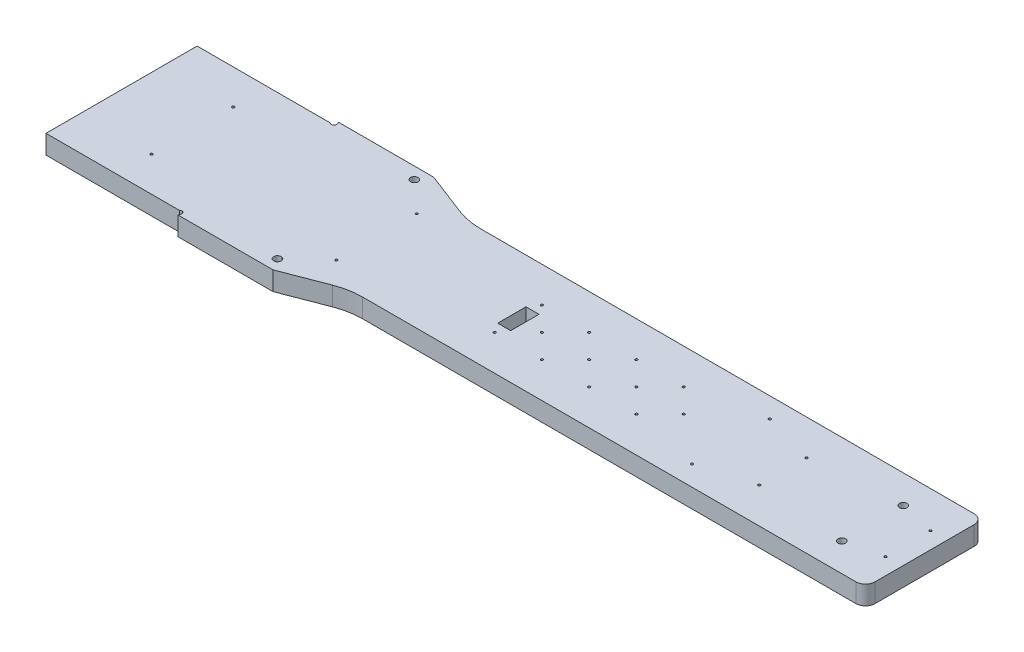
ISO-10303-21;
HEADER;
FILE_DESCRIPTION(('STEP AP214'),'2;1');
FILE_NAME('part.step','',(''),(''),'','','');
FILE_SCHEMA(('AUTOMOTIVE_DESIGN { 1 0 10303 214 1 1 1 1 }'));
ENDSEC;
DATA;
#1=APPLICATION_CONTEXT('core data for automotive mechanical design processes');
#2=APPLICATION_PROTOCOL_DEFINITION('international standard','automotive_design',2000,#1);
#3=PRODUCT_CONTEXT('',#1,'mechanical');
#4=PRODUCT('Part','Part','',(#3));
#5=PRODUCT_RELATED_PRODUCT_CATEGORY('part','',(#4));
#6=PRODUCT_DEFINITION_FORMATION('','',#4);
#7=PRODUCT_DEFINITION_CONTEXT('part definition',#1,'design');
#8=PRODUCT_DEFINITION('design','',#6,#7);
#9=PRODUCT_DEFINITION_SHAPE('','',#8);
#10=(LENGTH_UNIT() NAMED_UNIT(*) SI_UNIT(.MILLI.,.METRE.));
#11=(NAMED_UNIT(*) PLANE_ANGLE_UNIT() SI_UNIT($,.RADIAN.));
#12=(NAMED_UNIT(*) SI_UNIT($,.STERADIAN.) SOLID_ANGLE_UNIT());
#13=UNCERTAINTY_MEASURE_WITH_UNIT(LENGTH_MEASURE(1.E-05),#10,'distance_accuracy_value','');
#14=(GEOMETRIC_REPRESENTATION_CONTEXT(3) GLOBAL_UNCERTAINTY_ASSIGNED_CONTEXT((#13)) GLOBAL_UNIT_ASSIGNED_CONTEXT((#10,
#11,#12)) REPRESENTATION_CONTEXT('',''));
#15=CARTESIAN_POINT('',(0.,0.,0.));
#16=DIRECTION('',(0.,0.,1.));
#17=DIRECTION('',(1.,0.,0.));
#18=AXIS2_PLACEMENT_3D('',#15,#16,#17);
#19=CARTESIAN_POINT('',(280.,8.,9.99999999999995));
#20=DIRECTION('',(0.,-1.,0.));
#21=DIRECTION('',(0.,0.,-1.));
#22=AXIS2_PLACEMENT_3D('',#19,#20,#21);
#23=CYLINDRICAL_SURFACE('',#22,0.500000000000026);
#24=CARTESIAN_POINT('',(280.,8.,9.99999999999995));
#25=DIRECTION('',(0.,1.,0.));
#26=DIRECTION('',(0.,0.,1.));
#27=AXIS2_PLACEMENT_3D('',#24,#25,#26);
#28=CIRCLE('',#27,0.500000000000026);
#29=CARTESIAN_POINT('',(280.,8.,10.5));
#30=VERTEX_POINT('',#29);
#31=EDGE_CURVE('E481',#30,#30,#28,.T.);
#32=ORIENTED_EDGE('',*,*,#31,.T.);
#33=EDGE_LOOP('',(#32));
#34=FACE_BOUND('',#33,.T.);
#35=CARTESIAN_POINT('',(280.,6.,9.99999999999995));
#36=DIRECTION('',(0.,-1.,0.));
#37=DIRECTION('',(0.,0.,-1.));
#38=AXIS2_PLACEMENT_3D('',#35,#36,#37);
#39=CIRCLE('',#38,0.500000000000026);
#40=CARTESIAN_POINT('',(280.,6.,9.49999999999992));
#41=VERTEX_POINT('',#40);
#42=EDGE_CURVE('E331',#41,#41,#39,.T.);
#43=ORIENTED_EDGE('',*,*,#42,.T.);
#44=EDGE_LOOP('',(#43));
#45=FACE_BOUND('',#44,.T.);
#46=ADVANCED_FACE('F35',(#34,#45),#23,.F.);
#47=CARTESIAN_POINT('',(280.,8.,-10.0000000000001));
#48=DIRECTION('',(0.,-1.,0.));
#49=DIRECTION('',(0.,0.,-1.));
#50=AXIS2_PLACEMENT_3D('',#47,#48,#49);
#51=CYLINDRICAL_SURFACE('',#50,0.500000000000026);
#52=CARTESIAN_POINT('',(280.,8.,-10.0000000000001));
#53=DIRECTION('',(0.,1.,0.));
#54=DIRECTION('',(0.,0.,1.));
#55=AXIS2_PLACEMENT_3D('',#52,#53,#54);
#56=CIRCLE('',#55,0.500000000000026);
#57=CARTESIAN_POINT('',(280.,8.,-9.50000000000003));
#58=VERTEX_POINT('',#57);
#59=EDGE_CURVE('E476',#58,#58,#56,.T.);
#60=ORIENTED_EDGE('',*,*,#59,.T.);
#61=EDGE_LOOP('',(#60));
#62=FACE_BOUND('',#61,.T.);
#63=CARTESIAN_POINT('',(280.,6.,-10.0000000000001));
#64=DIRECTION('',(0.,-1.,0.));
#65=DIRECTION('',(0.,0.,-1.));
#66=AXIS2_PLACEMENT_3D('',#63,#64,#65);
#67=CIRCLE('',#66,0.500000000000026);
#68=CARTESIAN_POINT('',(280.,6.,-10.5000000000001));
#69=VERTEX_POINT('',#68);
#70=EDGE_CURVE('E39',#69,#69,#67,.T.);
#71=ORIENTED_EDGE('',*,*,#70,.T.);
#72=EDGE_LOOP('',(#71));
#73=FACE_BOUND('',#72,.T.);
#74=ADVANCED_FACE('F739',(#62,#73),#51,.F.);
#75=CARTESIAN_POINT('',(127.081213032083,8.,-55.));
#76=DIRECTION('',(0.,-1.,0.));
#77=DIRECTION('',(0.,0.,-1.));
#78=AXIS2_PLACEMENT_3D('',#75,#76,#77);
#79=PLANE('',#78);
#80=CARTESIAN_POINT('',(258.,8.,-16.5));
#81=DIRECTION('',(0.,-1.,0.));
#82=DIRECTION('',(0.,0.,1.));
#83=AXIS2_PLACEMENT_3D('',#80,#81,#82);
#84=CIRCLE('',#83,0.500000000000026);
#85=CARTESIAN_POINT('',(258.,8.,-16.));
#86=VERTEX_POINT('',#85);
#87=EDGE_CURVE('E335',#86,#86,#84,.T.);
#88=ORIENTED_EDGE('',*,*,#87,.T.);
#89=EDGE_LOOP('',(#88));
#90=FACE_BOUND('',#89,.T.);
#91=CARTESIAN_POINT('',(258.,8.,16.5));
#92=DIRECTION('',(0.,-1.,0.));
#93=DIRECTION('',(0.,0.,-1.));
#94=AXIS2_PLACEMENT_3D('',#91,#92,#93);
#95=CIRCLE('',#94,0.500000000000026);
#96=CARTESIAN_POINT('',(258.,8.,16.));
#97=VERTEX_POINT('',#96);
#98=EDGE_CURVE('E341',#97,#97,#95,.T.);
#99=ORIENTED_EDGE('',*,*,#98,.T.);
#100=EDGE_LOOP('',(#99));
#101=FACE_BOUND('',#100,.T.);
#102=DIRECTION('',(1.,0.,0.));
#103=VECTOR('',#102,1.);
#104=CARTESIAN_POINT('',(165.25,8.,-6.));
#105=LINE('',#104,#103);
#106=CARTESIAN_POINT('',(165.25,8.,-6.));
#107=VERTEX_POINT('',#106);
#108=CARTESIAN_POINT('',(170.75,8.,-6.));
#109=VERTEX_POINT('',#108);
#110=EDGE_CURVE('E355',#107,#109,#105,.T.);
#111=ORIENTED_EDGE('',*,*,#110,.T.);
#112=DIRECTION('',(0.,0.,1.));
#113=VECTOR('',#112,1.);
#114=CARTESIAN_POINT('',(170.75,8.,-6.));
#115=LINE('',#114,#113);
#116=CARTESIAN_POINT('',(170.75,8.,6.));
#117=VERTEX_POINT('',#116);
#118=EDGE_CURVE('E347',#109,#117,#115,.T.);
#119=ORIENTED_EDGE('',*,*,#118,.T.);
#120=DIRECTION('',(-1.,0.,0.));
#121=VECTOR('',#120,1.);
#122=CARTESIAN_POINT('',(165.25,8.,6.));
#123=LINE('',#122,#121);
#124=CARTESIAN_POINT('',(165.25,8.,6.));
#125=VERTEX_POINT('',#124);
#126=EDGE_CURVE('E350',#117,#125,#123,.T.);
#127=ORIENTED_EDGE('',*,*,#126,.T.);
#128=DIRECTION('',(0.,0.,-1.));
#129=VECTOR('',#128,1.);
#130=CARTESIAN_POINT('',(165.25,8.,-6.));
#131=LINE('',#130,#129);
#132=EDGE_CURVE('E59',#125,#107,#131,.T.);
#133=ORIENTED_EDGE('',*,*,#132,.T.);
#134=EDGE_LOOP('',(#111,#119,#127,#133));
#135=FACE_BOUND('',#134,.T.);
#136=CARTESIAN_POINT('',(168.,8.,-10.0000000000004));
#137=DIRECTION('',(0.,-1.,0.));
#138=DIRECTION('',(0.,0.,1.));
#139=AXIS2_PLACEMENT_3D('',#136,#137,#138);
#140=CIRCLE('',#139,0.499999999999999);
#141=CARTESIAN_POINT('',(168.,8.,-9.50000000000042));
#142=VERTEX_POINT('',#141);
#143=EDGE_CURVE('E377',#142,#142,#140,.T.);
#144=ORIENTED_EDGE('',*,*,#143,.T.);
#145=EDGE_LOOP('',(#144));
#146=FACE_BOUND('',#145,.T.);
#147=CARTESIAN_POINT('',(168.,8.,9.99999999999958));
#148=DIRECTION('',(0.,-1.,0.));
#149=DIRECTION('',(0.,0.,-1.));
#150=AXIS2_PLACEMENT_3D('',#147,#148,#149);
#151=CIRCLE('',#150,0.499999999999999);
#152=CARTESIAN_POINT('',(168.,8.,9.49999999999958));
#153=VERTEX_POINT('',#152);
#154=EDGE_CURVE('E383',#153,#153,#151,.T.);
#155=ORIENTED_EDGE('',*,*,#154,.T.);
#156=EDGE_LOOP('',(#155));
#157=FACE_BOUND('',#156,.T.);
#158=CARTESIAN_POINT('',(178.,8.,-4.14324102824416E-13));
#159=DIRECTION('',(0.,-1.,0.));
#160=DIRECTION('',(0.,0.,-1.));
#161=AXIS2_PLACEMENT_3D('',#158,#159,#160);
#162=CIRCLE('',#161,0.499999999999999);
#163=CARTESIAN_POINT('',(178.,8.,-0.500000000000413));
#164=VERTEX_POINT('',#163);
#165=EDGE_CURVE('E389',#164,#164,#162,.T.);
#166=ORIENTED_EDGE('',*,*,#165,.T.);
#167=EDGE_LOOP('',(#166));
#168=FACE_BOUND('',#167,.T.);
#169=CARTESIAN_POINT('',(188.,8.,-10.0000000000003));
#170=DIRECTION('',(0.,-1.,0.));
#171=DIRECTION('',(0.,0.,1.));
#172=AXIS2_PLACEMENT_3D('',#169,#170,#171);
#173=CIRCLE('',#172,0.499999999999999);
#174=CARTESIAN_POINT('',(188.,8.,-9.50000000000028));
#175=VERTEX_POINT('',#174);
#176=EDGE_CURVE('E395',#175,#175,#173,.T.);
#177=ORIENTED_EDGE('',*,*,#176,.T.);
#178=EDGE_LOOP('',(#177));
#179=FACE_BOUND('',#178,.T.);
#180=CARTESIAN_POINT('',(188.,8.,9.99999999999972));
#181=DIRECTION('',(0.,-1.,0.));
#182=DIRECTION('',(0.,0.,-1.));
#183=AXIS2_PLACEMENT_3D('',#180,#181,#182);
#184=CIRCLE('',#183,0.499999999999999);
#185=CARTESIAN_POINT('',(188.,8.,9.49999999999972));
#186=VERTEX_POINT('',#185);
#187=EDGE_CURVE('E401',#186,#186,#184,.T.);
#188=ORIENTED_EDGE('',*,*,#187,.T.);
#189=EDGE_LOOP('',(#188));
#190=FACE_BOUND('',#189,.T.);
#191=CARTESIAN_POINT('',(198.,8.,-2.74664849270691E-13));
#192=DIRECTION('',(0.,-1.,0.));
#193=DIRECTION('',(0.,0.,-1.));
#194=AXIS2_PLACEMENT_3D('',#191,#192,#193);
#195=CIRCLE('',#194,0.499999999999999);
#196=CARTESIAN_POINT('',(198.,8.,-0.500000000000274));
#197=VERTEX_POINT('',#196);
#198=EDGE_CURVE('E407',#197,#197,#195,.T.);
#199=ORIENTED_EDGE('',*,*,#198,.T.);
#200=EDGE_LOOP('',(#199));
#201=FACE_BOUND('',#200,.T.);
#202=CARTESIAN_POINT('',(208.,8.,-10.0000000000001));
#203=DIRECTION('',(0.,-1.,0.));
#204=DIRECTION('',(0.,0.,1.));
#205=AXIS2_PLACEMENT_3D('',#202,#203,#204);
#206=CIRCLE('',#205,0.499999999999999);
#207=CARTESIAN_POINT('',(208.,8.,-9.50000000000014));
#208=VERTEX_POINT('',#207);
#209=EDGE_CURVE('E413',#208,#208,#206,.T.);
#210=ORIENTED_EDGE('',*,*,#209,.T.);
#211=EDGE_LOOP('',(#210));
#212=FACE_BOUND('',#211,.T.);
#213=CARTESIAN_POINT('',(208.,8.,9.99999999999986));
#214=DIRECTION('',(0.,-1.,0.));
#215=DIRECTION('',(0.,0.,-1.));
#216=AXIS2_PLACEMENT_3D('',#213,#214,#215);
#217=CIRCLE('',#216,0.499999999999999);
#218=CARTESIAN_POINT('',(208.,8.,9.49999999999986));
#219=VERTEX_POINT('',#218);
#220=EDGE_CURVE('E419',#219,#219,#217,.T.);
#221=ORIENTED_EDGE('',*,*,#220,.T.);
#222=EDGE_LOOP('',(#221));
#223=FACE_BOUND('',#222,.T.);
#224=CARTESIAN_POINT('',(218.,8.,-1.35005595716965E-13));
#225=DIRECTION('',(0.,-1.,0.));
#226=DIRECTION('',(0.,0.,-1.));
#227=AXIS2_PLACEMENT_3D('',#224,#225,#226);
#228=CIRCLE('',#227,0.499999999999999);
#229=CARTESIAN_POINT('',(218.,8.,-0.500000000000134));
#230=VERTEX_POINT('',#229);
#231=EDGE_CURVE('E425',#230,#230,#228,.T.);
#232=ORIENTED_EDGE('',*,*,#231,.T.);
#233=EDGE_LOOP('',(#232));
#234=FACE_BOUND('',#233,.T.);
#235=CARTESIAN_POINT('',(228.,8.,-10.));
#236=DIRECTION('',(0.,-1.,0.));
#237=DIRECTION('',(0.,0.,1.));
#238=AXIS2_PLACEMENT_3D('',#235,#236,#237);
#239=CIRCLE('',#238,0.499999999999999);
#240=CARTESIAN_POINT('',(228.,8.,-9.5));
#241=VERTEX_POINT('',#240);
#242=EDGE_CURVE('E431',#241,#241,#239,.T.);
#243=ORIENTED_EDGE('',*,*,#242,.T.);
#244=EDGE_LOOP('',(#243));
#245=FACE_BOUND('',#244,.T.);
#246=CARTESIAN_POINT('',(228.,8.,10.));
#247=DIRECTION('',(0.,-1.,0.));
#248=DIRECTION('',(0.,0.,-1.));
#249=AXIS2_PLACEMENT_3D('',#246,#247,#248);
#250=CIRCLE('',#249,0.499999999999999);
#251=CARTESIAN_POINT('',(228.,8.,9.5));
#252=VERTEX_POINT('',#251);
#253=EDGE_CURVE('E437',#252,#252,#250,.T.);
#254=ORIENTED_EDGE('',*,*,#253,.T.);
#255=EDGE_LOOP('',(#254));
#256=FACE_BOUND('',#255,.T.);
#257=CARTESIAN_POINT('',(238.,8.,0.));
#258=DIRECTION('',(0.,-1.,0.));
#259=DIRECTION('',(0.,0.,-1.));
#260=AXIS2_PLACEMENT_3D('',#257,#258,#259);
#261=CIRCLE('',#260,0.499999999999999);
#262=CARTESIAN_POINT('',(238.,8.,-0.499999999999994));
#263=VERTEX_POINT('',#262);
#264=EDGE_CURVE('E443',#263,#263,#261,.T.);
#265=ORIENTED_EDGE('',*,*,#264,.T.);
#266=EDGE_LOOP('',(#265));
#267=FACE_BOUND('',#266,.T.);
#268=CARTESIAN_POINT('',(127.081213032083,8.,-55.));
#269=DIRECTION('',(0.,-1.,0.));
#270=DIRECTION('',(0.,0.,-1.));
#271=AXIS2_PLACEMENT_3D('',#268,#269,#270);
#272=CIRCLE('',#271,30.);
#273=CARTESIAN_POINT('',(127.081213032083,8.,-25.));
#274=VERTEX_POINT('',#273);
#275=CARTESIAN_POINT('',(116.299250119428,8.,-27.0044775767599));
#276=VERTEX_POINT('',#275);
#277=EDGE_CURVE('E515',#274,#276,#272,.T.);
#278=ORIENTED_EDGE('',*,*,#277,.T.);
#279=DIRECTION('',(-0.93318408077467,0.,-0.359398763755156));
#280=VECTOR('',#279,1.);
#281=CARTESIAN_POINT('',(98.1352751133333,8.,-34.));
#282=LINE('',#281,#280);
#283=CARTESIAN_POINT('',(98.1352751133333,8.,-34.));
#284=VERTEX_POINT('',#283);
#285=EDGE_CURVE('E518',#276,#284,#282,.T.);
#286=ORIENTED_EDGE('',*,*,#285,.T.);
#287=DIRECTION('',(-1.,0.,0.));
#288=VECTOR('',#287,1.);
#289=CARTESIAN_POINT('',(98.1352751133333,8.,-34.));
#290=LINE('',#289,#288);
#291=CARTESIAN_POINT('',(58.,8.,-34.));
#292=VERTEX_POINT('',#291);
#293=EDGE_CURVE('E521',#284,#292,#290,.T.);
#294=ORIENTED_EDGE('',*,*,#293,.T.);
#295=DIRECTION('',(0.,0.,1.));
#296=VECTOR('',#295,1.);
#297=CARTESIAN_POINT('',(58.,8.,-33.5556349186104));
#298=LINE('',#297,#296);
#299=CARTESIAN_POINT('',(58.,8.,-33.5556349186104));
#300=VERTEX_POINT('',#299);
#301=EDGE_CURVE('E523',#292,#300,#298,.T.);
#302=ORIENTED_EDGE('',*,*,#301,.T.);
#303=CARTESIAN_POINT('',(57.2221825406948,8.,-32.7778174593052));
#304=DIRECTION('',(0.,-1.,0.));
#305=DIRECTION('',(0.,0.,1.));
#306=AXIS2_PLACEMENT_3D('',#303,#304,#305);
#307=CIRCLE('',#306,1.09999999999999);
#308=CARTESIAN_POINT('',(56.4443650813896,8.,-32.));
#309=VERTEX_POINT('',#308);
#310=EDGE_CURVE('E525',#300,#309,#307,.T.);
#311=ORIENTED_EDGE('',*,*,#310,.T.);
#312=DIRECTION('',(-1.,0.,0.));
#313=VECTOR('',#312,1.);
#314=CARTESIAN_POINT('',(56.4443650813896,8.,-32.));
#315=LINE('',#314,#313);
#316=CARTESIAN_POINT('',(0.,8.,-32.));
#317=VERTEX_POINT('',#316);
#318=EDGE_CURVE('E527',#309,#317,#315,.T.);
#319=ORIENTED_EDGE('',*,*,#318,.T.);
#320=DIRECTION('',(0.,0.,1.));
#321=VECTOR('',#320,1.);
#322=CARTESIAN_POINT('',(0.,8.,-32.));
#323=LINE('',#322,#321);
#324=CARTESIAN_POINT('',(0.,8.,32.));
#325=VERTEX_POINT('',#324);
#326=EDGE_CURVE('E529',#317,#325,#323,.T.);
#327=ORIENTED_EDGE('',*,*,#326,.T.);
#328=DIRECTION('',(1.,0.,0.));
#329=VECTOR('',#328,1.);
#330=CARTESIAN_POINT('',(56.4443650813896,8.,32.));
#331=LINE('',#330,#329);
#332=CARTESIAN_POINT('',(56.4443650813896,8.,32.));
#333=VERTEX_POINT('',#332);
#334=EDGE_CURVE('E531',#325,#333,#331,.T.);
#335=ORIENTED_EDGE('',*,*,#334,.T.);
#336=CARTESIAN_POINT('',(57.2221825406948,8.,32.7778174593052));
#337=DIRECTION('',(0.,-1.,0.));
#338=DIRECTION('',(0.,0.,-1.));
#339=AXIS2_PLACEMENT_3D('',#336,#337,#338);
#340=CIRCLE('',#339,1.09999999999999);
#341=CARTESIAN_POINT('',(58.,8.,33.5556349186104));
#342=VERTEX_POINT('',#341);
#343=EDGE_CURVE('E533',#333,#342,#340,.T.);
#344=ORIENTED_EDGE('',*,*,#343,.T.);
#345=DIRECTION('',(0.,0.,1.));
#346=VECTOR('',#345,1.);
#347=CARTESIAN_POINT('',(58.,8.,33.5556349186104));
#348=LINE('',#347,#346);
#349=CARTESIAN_POINT('',(58.,8.,34.));
#350=VERTEX_POINT('',#349);
#351=EDGE_CURVE('E535',#342,#350,#348,.T.);
#352=ORIENTED_EDGE('',*,*,#351,.T.);
#353=DIRECTION('',(1.,0.,0.));
#354=VECTOR('',#353,1.);
#355=CARTESIAN_POINT('',(98.1352751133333,8.,34.));
#356=LINE('',#355,#354);
#357=CARTESIAN_POINT('',(98.1352751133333,8.,34.));
#358=VERTEX_POINT('',#357);
#359=EDGE_CURVE('E537',#350,#358,#356,.T.);
#360=ORIENTED_EDGE('',*,*,#359,.T.);
#361=DIRECTION('',(0.933184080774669,0.,-0.359398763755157));
#362=VECTOR('',#361,1.);
#363=CARTESIAN_POINT('',(98.1352751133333,8.,34.));
#364=LINE('',#363,#362);
#365=CARTESIAN_POINT('',(116.299250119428,8.,27.0044775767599));
#366=VERTEX_POINT('',#365);
#367=EDGE_CURVE('E539',#358,#366,#364,.T.);
#368=ORIENTED_EDGE('',*,*,#367,.T.);
#369=CARTESIAN_POINT('',(127.081213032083,8.,55.));
#370=DIRECTION('',(0.,-1.,0.));
#371=DIRECTION('',(0.,0.,1.));
#372=AXIS2_PLACEMENT_3D('',#369,#370,#371);
#373=CIRCLE('',#372,30.);
#374=CARTESIAN_POINT('',(127.081213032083,8.,25.));
#375=VERTEX_POINT('',#374);
#376=EDGE_CURVE('E541',#366,#375,#373,.T.);
#377=ORIENTED_EDGE('',*,*,#376,.T.);
#378=DIRECTION('',(1.,0.,0.));
#379=VECTOR('',#378,1.);
#380=CARTESIAN_POINT('',(127.081213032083,8.,25.));
#381=LINE('',#380,#379);
#382=CARTESIAN_POINT('',(336.,8.,25.));
#383=VERTEX_POINT('',#382);
#384=EDGE_CURVE('E543',#375,#383,#381,.T.);
#385=ORIENTED_EDGE('',*,*,#384,.T.);
#386=CARTESIAN_POINT('',(336.,8.,21.));
#387=DIRECTION('',(0.,1.,0.));
#388=DIRECTION('',(0.,0.,1.));
#389=AXIS2_PLACEMENT_3D('',#386,#387,#388);
#390=CIRCLE('',#389,3.99999999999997);
#391=CARTESIAN_POINT('',(340.,8.,21.));
#392=VERTEX_POINT('',#391);
#393=EDGE_CURVE('E545',#383,#392,#390,.T.);
#394=ORIENTED_EDGE('',*,*,#393,.T.);
#395=DIRECTION('',(0.,0.,-1.));
#396=VECTOR('',#395,1.);
#397=CARTESIAN_POINT('',(340.,8.,-21.));
#398=LINE('',#397,#396);
#399=CARTESIAN_POINT('',(340.,8.,-21.));
#400=VERTEX_POINT('',#399);
#401=EDGE_CURVE('E547',#392,#400,#398,.T.);
#402=ORIENTED_EDGE('',*,*,#401,.T.);
#403=CARTESIAN_POINT('',(336.,8.,-21.));
#404=DIRECTION('',(0.,1.,0.));
#405=DIRECTION('',(0.,0.,-1.));
#406=AXIS2_PLACEMENT_3D('',#403,#404,#405);
#407=CIRCLE('',#406,3.99999999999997);
#408=CARTESIAN_POINT('',(336.,8.,-25.));
#409=VERTEX_POINT('',#408);
#410=EDGE_CURVE('E549',#400,#409,#407,.T.);
#411=ORIENTED_EDGE('',*,*,#410,.T.);
#412=DIRECTION('',(-1.,0.,0.));
#413=VECTOR('',#412,1.);
#414=CARTESIAN_POINT('',(127.081213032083,8.,-25.));
#415=LINE('',#414,#413);
#416=EDGE_CURVE('E551',#409,#274,#415,.T.);
#417=ORIENTED_EDGE('',*,*,#416,.T.);
#418=EDGE_LOOP('',(#278,#286,#294,#302,#311,#319,#327,#335,#344,#352,#360,#368,#377,#385,#394,
#402,#411,#417));
#419=FACE_BOUND('',#418,.T.);
#420=CARTESIAN_POINT('',(30.,8.,17.3));
#421=DIRECTION('',(0.,1.,0.));
#422=DIRECTION('',(0.,0.,1.));
#423=AXIS2_PLACEMENT_3D('',#420,#421,#422);
#424=CIRCLE('',#423,0.499999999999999);
#425=CARTESIAN_POINT('',(30.,8.,17.8));
#426=VERTEX_POINT('',#425);
#427=EDGE_CURVE('E509',#426,#426,#424,.T.);
#428=ORIENTED_EDGE('',*,*,#427,.F.);
#429=EDGE_LOOP('',(#428));
#430=FACE_BOUND('',#429,.T.);
#431=CARTESIAN_POINT('',(30.,8.,-17.3));
#432=DIRECTION('',(0.,1.,0.));
#433=DIRECTION('',(0.,0.,-1.));
#434=AXIS2_PLACEMENT_3D('',#431,#432,#433);
#435=CIRCLE('',#434,0.499999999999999);
#436=CARTESIAN_POINT('',(30.,8.,-17.8));
#437=VERTEX_POINT('',#436);
#438=EDGE_CURVE('E503',#437,#437,#435,.T.);
#439=ORIENTED_EDGE('',*,*,#438,.F.);
#440=EDGE_LOOP('',(#439));
#441=FACE_BOUND('',#440,.T.);
#442=CARTESIAN_POINT('',(333.,8.,9.5));
#443=DIRECTION('',(0.,1.,0.));
#444=DIRECTION('',(0.,0.,-1.));
#445=AXIS2_PLACEMENT_3D('',#442,#443,#444);
#446=CIRCLE('',#445,0.500000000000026);
#447=CARTESIAN_POINT('',(333.,8.,8.99999999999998));
#448=VERTEX_POINT('',#447);
#449=EDGE_CURVE('E497',#448,#448,#446,.T.);
#450=ORIENTED_EDGE('',*,*,#449,.F.);
#451=EDGE_LOOP('',(#450));
#452=FACE_BOUND('',#451,.T.);
#453=CARTESIAN_POINT('',(108.,8.,17.));
#454=DIRECTION('',(0.,1.,0.));
#455=DIRECTION('',(0.,0.,1.));
#456=AXIS2_PLACEMENT_3D('',#453,#454,#455);
#457=CIRCLE('',#456,0.499999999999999);
#458=CARTESIAN_POINT('',(108.,8.,17.5));
#459=VERTEX_POINT('',#458);
#460=EDGE_CURVE('E491',#459,#459,#457,.T.);
#461=ORIENTED_EDGE('',*,*,#460,.F.);
#462=EDGE_LOOP('',(#461));
#463=FACE_BOUND('',#462,.T.);
#464=CARTESIAN_POINT('',(108.,8.,-17.));
#465=DIRECTION('',(0.,1.,0.));
#466=DIRECTION('',(0.,0.,-1.));
#467=AXIS2_PLACEMENT_3D('',#464,#465,#466);
#468=CIRCLE('',#467,0.499999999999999);
#469=CARTESIAN_POINT('',(108.,8.,-17.5));
#470=VERTEX_POINT('',#469);
#471=EDGE_CURVE('E485',#470,#470,#468,.T.);
#472=ORIENTED_EDGE('',*,*,#471,.F.);
#473=EDGE_LOOP('',(#472));
#474=FACE_BOUND('',#473,.T.);
#475=ORIENTED_EDGE('',*,*,#31,.F.);
#476=EDGE_LOOP('',(#475));
#477=FACE_BOUND('',#476,.T.);
#478=ORIENTED_EDGE('',*,*,#59,.F.);
#479=EDGE_LOOP('',(#478));
#480=FACE_BOUND('',#479,.T.);
#481=CARTESIAN_POINT('',(333.,8.,-9.5));
#482=DIRECTION('',(0.,1.,0.));
#483=DIRECTION('',(0.,0.,1.));
#484=AXIS2_PLACEMENT_3D('',#481,#482,#483);
#485=CIRCLE('',#484,0.500000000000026);
#486=CARTESIAN_POINT('',(333.,8.,-8.99999999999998));
#487=VERTEX_POINT('',#486);
#488=EDGE_CURVE('E473',#487,#487,#485,.T.);
#489=ORIENTED_EDGE('',*,*,#488,.F.);
#490=EDGE_LOOP('',(#489));
#491=FACE_BOUND('',#490,.T.);
#492=CARTESIAN_POINT('',(95.,8.,29.));
#493=DIRECTION('',(0.,1.,0.));
#494=DIRECTION('',(0.,0.,1.));
#495=AXIS2_PLACEMENT_3D('',#492,#493,#494);
#496=CIRCLE('',#495,1.6);
#497=CARTESIAN_POINT('',(95.,8.,30.6));
#498=VERTEX_POINT('',#497);
#499=EDGE_CURVE('E467',#498,#498,#496,.T.);
#500=ORIENTED_EDGE('',*,*,#499,.F.);
#501=EDGE_LOOP('',(#500));
#502=FACE_BOUND('',#501,.T.);
#503=CARTESIAN_POINT('',(95.,8.,-29.));
#504=DIRECTION('',(0.,1.,0.));
#505=DIRECTION('',(0.,0.,-1.));
#506=AXIS2_PLACEMENT_3D('',#503,#504,#505);
#507=CIRCLE('',#506,1.6);
#508=CARTESIAN_POINT('',(95.,8.,-30.6));
#509=VERTEX_POINT('',#508);
#510=EDGE_CURVE('E461',#509,#509,#507,.T.);
#511=ORIENTED_EDGE('',*,*,#510,.F.);
#512=EDGE_LOOP('',(#511));
#513=FACE_BOUND('',#512,.T.);
#514=CARTESIAN_POINT('',(318.,8.,-13.));
#515=DIRECTION('',(0.,1.,0.));
#516=DIRECTION('',(0.,0.,1.));
#517=AXIS2_PLACEMENT_3D('',#514,#515,#516);
#518=CIRCLE('',#517,1.59999999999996);
#519=CARTESIAN_POINT('',(318.,8.,-11.4));
#520=VERTEX_POINT('',#519);
#521=EDGE_CURVE('E455',#520,#520,#518,.T.);
#522=ORIENTED_EDGE('',*,*,#521,.F.);
#523=EDGE_LOOP('',(#522));
#524=FACE_BOUND('',#523,.T.);
#525=CARTESIAN_POINT('',(318.,8.,13.));
#526=DIRECTION('',(0.,1.,0.));
#527=DIRECTION('',(0.,0.,-1.));
#528=AXIS2_PLACEMENT_3D('',#525,#526,#527);
#529=CIRCLE('',#528,1.59999999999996);
#530=CARTESIAN_POINT('',(318.,8.,11.4));
#531=VERTEX_POINT('',#530);
#532=EDGE_CURVE('E449',#531,#531,#529,.T.);
#533=ORIENTED_EDGE('',*,*,#532,.F.);
#534=EDGE_LOOP('',(#533));
#535=FACE_BOUND('',#534,.T.);
#536=ADVANCED_FACE('F661',(#90,#101,#135,#146,#157,#168,#179,#190,#201,#212,#223,#234,#245,#256,
#267,#419,#430,#441,#452,#463,#474,#477,#480,#491,#502,#513,#524,#535),#79,.F.);
#537=CARTESIAN_POINT('',(127.081213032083,0.,-55.));
#538=DIRECTION('',(0.,-1.,0.));
#539=DIRECTION('',(0.,0.,-1.));
#540=AXIS2_PLACEMENT_3D('',#537,#538,#539);
#541=PLANE('',#540);
#542=CARTESIAN_POINT('',(280.,0.,-10.0000000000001));
#543=DIRECTION('',(0.,-1.,0.));
#544=DIRECTION('',(0.,0.,-1.));
#545=AXIS2_PLACEMENT_3D('',#542,#543,#544);
#546=CIRCLE('',#545,2.30000000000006);
#547=CARTESIAN_POINT('',(277.719649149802,0.,-10.3));
#548=VERTEX_POINT('',#547);
#549=CARTESIAN_POINT('',(282.280350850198,0.,-10.3));
#550=VERTEX_POINT('',#549);
#551=EDGE_CURVE('E51',#548,#550,#546,.T.);
#552=ORIENTED_EDGE('',*,*,#551,.F.);
#553=DIRECTION('',(1.,0.,0.));
#554=VECTOR('',#553,1.);
#555=CARTESIAN_POINT('',(269.7,0.,-10.3));
#556=LINE('',#555,#554);
#557=CARTESIAN_POINT('',(269.7,0.,-10.3));
#558=VERTEX_POINT('',#557);
#559=EDGE_CURVE('E266',#558,#548,#556,.T.);
#560=ORIENTED_EDGE('',*,*,#559,.F.);
#561=DIRECTION('',(0.,0.,-1.));
#562=VECTOR('',#561,1.);
#563=CARTESIAN_POINT('',(269.7,0.,10.3));
#564=LINE('',#563,#562);
#565=CARTESIAN_POINT('',(269.7,0.,10.3));
#566=VERTEX_POINT('',#565);
#567=EDGE_CURVE('E269',#566,#558,#564,.T.);
#568=ORIENTED_EDGE('',*,*,#567,.F.);
#569=DIRECTION('',(-1.,0.,0.));
#570=VECTOR('',#569,1.);
#571=CARTESIAN_POINT('',(269.7,0.,10.3));
#572=LINE('',#571,#570);
#573=CARTESIAN_POINT('',(277.719649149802,0.,10.3));
#574=VERTEX_POINT('',#573);
#575=EDGE_CURVE('E309',#574,#566,#572,.T.);
#576=ORIENTED_EDGE('',*,*,#575,.F.);
#577=CARTESIAN_POINT('',(280.,0.,9.99999999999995));
#578=DIRECTION('',(0.,-1.,0.));
#579=DIRECTION('',(0.,0.,-1.));
#580=AXIS2_PLACEMENT_3D('',#577,#578,#579);
#581=CIRCLE('',#580,2.30000000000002);
#582=CARTESIAN_POINT('',(282.280350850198,0.,10.3));
#583=VERTEX_POINT('',#582);
#584=EDGE_CURVE('E306',#583,#574,#581,.T.);
#585=ORIENTED_EDGE('',*,*,#584,.F.);
#586=DIRECTION('',(-1.,0.,0.));
#587=VECTOR('',#586,1.);
#588=CARTESIAN_POINT('',(282.280350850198,0.,10.3));
#589=LINE('',#588,#587);
#590=CARTESIAN_POINT('',(310.3,0.,10.3));
#591=VERTEX_POINT('',#590);
#592=EDGE_CURVE('E303',#591,#583,#589,.T.);
#593=ORIENTED_EDGE('',*,*,#592,.F.);
#594=DIRECTION('',(0.,0.,1.));
#595=VECTOR('',#594,1.);
#596=CARTESIAN_POINT('',(310.3,0.,10.3));
#597=LINE('',#596,#595);
#598=CARTESIAN_POINT('',(310.3,0.,2.28035085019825));
#599=VERTEX_POINT('',#598);
#600=EDGE_CURVE('E300',#599,#591,#597,.T.);
#601=ORIENTED_EDGE('',*,*,#600,.F.);
#602=CARTESIAN_POINT('',(310.,0.,0.));
#603=DIRECTION('',(0.,-1.,0.));
#604=DIRECTION('',(0.,0.,-1.));
#605=AXIS2_PLACEMENT_3D('',#602,#603,#604);
#606=CIRCLE('',#605,2.30000000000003);
#607=CARTESIAN_POINT('',(310.3,0.,-2.28035085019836));
#608=VERTEX_POINT('',#607);
#609=EDGE_CURVE('E297',#608,#599,#606,.T.);
#610=ORIENTED_EDGE('',*,*,#609,.F.);
#611=DIRECTION('',(0.,0.,1.));
#612=VECTOR('',#611,1.);
#613=CARTESIAN_POINT('',(310.3,0.,-2.28035085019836));
#614=LINE('',#613,#612);
#615=CARTESIAN_POINT('',(310.3,0.,-10.3));
#616=VERTEX_POINT('',#615);
#617=EDGE_CURVE('E294',#616,#608,#614,.T.);
#618=ORIENTED_EDGE('',*,*,#617,.F.);
#619=DIRECTION('',(1.,0.,0.));
#620=VECTOR('',#619,1.);
#621=CARTESIAN_POINT('',(282.280350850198,0.,-10.3));
#622=LINE('',#621,#620);
#623=EDGE_CURVE('E292',#550,#616,#622,.T.);
#624=ORIENTED_EDGE('',*,*,#623,.F.);
#625=EDGE_LOOP('',(#552,#560,#568,#576,#585,#593,#601,#610,#618,#624));
#626=FACE_BOUND('',#625,.T.);
#627=CARTESIAN_POINT('',(258.,0.,-16.5));
#628=DIRECTION('',(0.,-1.,0.));
#629=DIRECTION('',(0.,0.,1.));
#630=AXIS2_PLACEMENT_3D('',#627,#628,#629);
#631=CIRCLE('',#630,0.500000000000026);
#632=CARTESIAN_POINT('',(258.,0.,-16.));
#633=VERTEX_POINT('',#632);
#634=EDGE_CURVE('E334',#633,#633,#631,.T.);
#635=ORIENTED_EDGE('',*,*,#634,.F.);
#636=EDGE_LOOP('',(#635));
#637=FACE_BOUND('',#636,.T.);
#638=CARTESIAN_POINT('',(258.,0.,16.5));
#639=DIRECTION('',(0.,-1.,0.));
#640=DIRECTION('',(0.,0.,-1.));
#641=AXIS2_PLACEMENT_3D('',#638,#639,#640);
#642=CIRCLE('',#641,0.500000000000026);
#643=CARTESIAN_POINT('',(258.,0.,16.));
#644=VERTEX_POINT('',#643);
#645=EDGE_CURVE('E338',#644,#644,#642,.T.);
#646=ORIENTED_EDGE('',*,*,#645,.F.);
#647=EDGE_LOOP('',(#646));
#648=FACE_BOUND('',#647,.T.);
#649=DIRECTION('',(0.,0.,1.));
#650=VECTOR('',#649,1.);
#651=CARTESIAN_POINT('',(170.75,0.,-6.));
#652=LINE('',#651,#650);
#653=CARTESIAN_POINT('',(170.75,0.,-6.));
#654=VERTEX_POINT('',#653);
#655=CARTESIAN_POINT('',(170.75,0.,6.));
#656=VERTEX_POINT('',#655);
#657=EDGE_CURVE('E344',#654,#656,#652,.T.);
#658=ORIENTED_EDGE('',*,*,#657,.F.);
#659=DIRECTION('',(1.,0.,0.));
#660=VECTOR('',#659,1.);
#661=CARTESIAN_POINT('',(165.25,0.,-6.));
#662=LINE('',#661,#660);
#663=CARTESIAN_POINT('',(165.25,0.,-6.));
#664=VERTEX_POINT('',#663);
#665=EDGE_CURVE('E351',#664,#654,#662,.T.);
#666=ORIENTED_EDGE('',*,*,#665,.F.);
#667=DIRECTION('',(0.,0.,-1.));
#668=VECTOR('',#667,1.);
#669=CARTESIAN_POINT('',(165.25,0.,-6.));
#670=LINE('',#669,#668);
#671=CARTESIAN_POINT('',(165.25,0.,6.));
#672=VERTEX_POINT('',#671);
#673=EDGE_CURVE('E363',#672,#664,#670,.T.);
#674=ORIENTED_EDGE('',*,*,#673,.F.);
#675=DIRECTION('',(-1.,0.,0.));
#676=VECTOR('',#675,1.);
#677=CARTESIAN_POINT('',(165.25,0.,6.));
#678=LINE('',#677,#676);
#679=EDGE_CURVE('E360',#656,#672,#678,.T.);
#680=ORIENTED_EDGE('',*,*,#679,.F.);
#681=EDGE_LOOP('',(#658,#666,#674,#680));
#682=FACE_BOUND('',#681,.T.);
#683=CARTESIAN_POINT('',(168.,0.,-10.0000000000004));
#684=DIRECTION('',(0.,-1.,0.));
#685=DIRECTION('',(0.,0.,1.));
#686=AXIS2_PLACEMENT_3D('',#683,#684,#685);
#687=CIRCLE('',#686,0.499999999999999);
#688=CARTESIAN_POINT('',(168.,0.,-9.50000000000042));
#689=VERTEX_POINT('',#688);
#690=EDGE_CURVE('E370',#689,#689,#687,.T.);
#691=ORIENTED_EDGE('',*,*,#690,.F.);
#692=EDGE_LOOP('',(#691));
#693=FACE_BOUND('',#692,.T.);
#694=CARTESIAN_POINT('',(168.,0.,9.99999999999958));
#695=DIRECTION('',(0.,-1.,0.));
#696=DIRECTION('',(0.,0.,-1.));
#697=AXIS2_PLACEMENT_3D('',#694,#695,#696);
#698=CIRCLE('',#697,0.499999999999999);
#699=CARTESIAN_POINT('',(168.,0.,9.49999999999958));
#700=VERTEX_POINT('',#699);
#701=EDGE_CURVE('E380',#700,#700,#698,.T.);
#702=ORIENTED_EDGE('',*,*,#701,.F.);
#703=EDGE_LOOP('',(#702));
#704=FACE_BOUND('',#703,.T.);
#705=CARTESIAN_POINT('',(178.,0.,-4.14324102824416E-13));
#706=DIRECTION('',(0.,-1.,0.));
#707=DIRECTION('',(0.,0.,-1.));
#708=AXIS2_PLACEMENT_3D('',#705,#706,#707);
#709=CIRCLE('',#708,0.499999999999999);
#710=CARTESIAN_POINT('',(178.,0.,-0.500000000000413));
#711=VERTEX_POINT('',#710);
#712=EDGE_CURVE('E386',#711,#711,#709,.T.);
#713=ORIENTED_EDGE('',*,*,#712,.F.);
#714=EDGE_LOOP('',(#713));
#715=FACE_BOUND('',#714,.T.);
#716=CARTESIAN_POINT('',(188.,0.,-10.0000000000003));
#717=DIRECTION('',(0.,-1.,0.));
#718=DIRECTION('',(0.,0.,1.));
#719=AXIS2_PLACEMENT_3D('',#716,#717,#718);
#720=CIRCLE('',#719,0.499999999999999);
#721=CARTESIAN_POINT('',(188.,0.,-9.50000000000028));
#722=VERTEX_POINT('',#721);
#723=EDGE_CURVE('E392',#722,#722,#720,.T.);
#724=ORIENTED_EDGE('',*,*,#723,.F.);
#725=EDGE_LOOP('',(#724));
#726=FACE_BOUND('',#725,.T.);
#727=CARTESIAN_POINT('',(188.,0.,9.99999999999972));
#728=DIRECTION('',(0.,-1.,0.));
#729=DIRECTION('',(0.,0.,-1.));
#730=AXIS2_PLACEMENT_3D('',#727,#728,#729);
#731=CIRCLE('',#730,0.499999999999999);
#732=CARTESIAN_POINT('',(188.,0.,9.49999999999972));
#733=VERTEX_POINT('',#732);
#734=EDGE_CURVE('E398',#733,#733,#731,.T.);
#735=ORIENTED_EDGE('',*,*,#734,.F.);
#736=EDGE_LOOP('',(#735));
#737=FACE_BOUND('',#736,.T.);
#738=CARTESIAN_POINT('',(198.,0.,-2.74664849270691E-13));
#739=DIRECTION('',(0.,-1.,0.));
#740=DIRECTION('',(0.,0.,-1.));
#741=AXIS2_PLACEMENT_3D('',#738,#739,#740);
#742=CIRCLE('',#741,0.499999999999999);
#743=CARTESIAN_POINT('',(198.,0.,-0.500000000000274));
#744=VERTEX_POINT('',#743);
#745=EDGE_CURVE('E404',#744,#744,#742,.T.);
#746=ORIENTED_EDGE('',*,*,#745,.F.);
#747=EDGE_LOOP('',(#746));
#748=FACE_BOUND('',#747,.T.);
#749=CARTESIAN_POINT('',(208.,0.,-10.0000000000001));
#750=DIRECTION('',(0.,-1.,0.));
#751=DIRECTION('',(0.,0.,1.));
#752=AXIS2_PLACEMENT_3D('',#749,#750,#751);
#753=CIRCLE('',#752,0.499999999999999);
#754=CARTESIAN_POINT('',(208.,0.,-9.50000000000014));
#755=VERTEX_POINT('',#754);
#756=EDGE_CURVE('E410',#755,#755,#753,.T.);
#757=ORIENTED_EDGE('',*,*,#756,.F.);
#758=EDGE_LOOP('',(#757));
#759=FACE_BOUND('',#758,.T.);
#760=CARTESIAN_POINT('',(208.,0.,9.99999999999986));
#761=DIRECTION('',(0.,-1.,0.));
#762=DIRECTION('',(0.,0.,-1.));
#763=AXIS2_PLACEMENT_3D('',#760,#761,#762);
#764=CIRCLE('',#763,0.499999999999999);
#765=CARTESIAN_POINT('',(208.,0.,9.49999999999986));
#766=VERTEX_POINT('',#765);
#767=EDGE_CURVE('E416',#766,#766,#764,.T.);
#768=ORIENTED_EDGE('',*,*,#767,.F.);
#769=EDGE_LOOP('',(#768));
#770=FACE_BOUND('',#769,.T.);
#771=CARTESIAN_POINT('',(218.,0.,-1.35005595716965E-13));
#772=DIRECTION('',(0.,-1.,0.));
#773=DIRECTION('',(0.,0.,-1.));
#774=AXIS2_PLACEMENT_3D('',#771,#772,#773);
#775=CIRCLE('',#774,0.499999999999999);
#776=CARTESIAN_POINT('',(218.,0.,-0.500000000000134));
#777=VERTEX_POINT('',#776);
#778=EDGE_CURVE('E422',#777,#777,#775,.T.);
#779=ORIENTED_EDGE('',*,*,#778,.F.);
#780=EDGE_LOOP('',(#779));
#781=FACE_BOUND('',#780,.T.);
#782=CARTESIAN_POINT('',(228.,0.,-10.));
#783=DIRECTION('',(0.,-1.,0.));
#784=DIRECTION('',(0.,0.,1.));
#785=AXIS2_PLACEMENT_3D('',#782,#783,#784);
#786=CIRCLE('',#785,0.499999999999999);
#787=CARTESIAN_POINT('',(228.,0.,-9.5));
#788=VERTEX_POINT('',#787);
#789=EDGE_CURVE('E428',#788,#788,#786,.T.);
#790=ORIENTED_EDGE('',*,*,#789,.F.);
#791=EDGE_LOOP('',(#790));
#792=FACE_BOUND('',#791,.T.);
#793=CARTESIAN_POINT('',(228.,0.,10.));
#794=DIRECTION('',(0.,-1.,0.));
#795=DIRECTION('',(0.,0.,-1.));
#796=AXIS2_PLACEMENT_3D('',#793,#794,#795);
#797=CIRCLE('',#796,0.499999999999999);
#798=CARTESIAN_POINT('',(228.,0.,9.5));
#799=VERTEX_POINT('',#798);
#800=EDGE_CURVE('E434',#799,#799,#797,.T.);
#801=ORIENTED_EDGE('',*,*,#800,.F.);
#802=EDGE_LOOP('',(#801));
#803=FACE_BOUND('',#802,.T.);
#804=CARTESIAN_POINT('',(238.,0.,0.));
#805=DIRECTION('',(0.,-1.,0.));
#806=DIRECTION('',(0.,0.,-1.));
#807=AXIS2_PLACEMENT_3D('',#804,#805,#806);
#808=CIRCLE('',#807,0.499999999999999);
#809=CARTESIAN_POINT('',(238.,0.,-0.499999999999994));
#810=VERTEX_POINT('',#809);
#811=EDGE_CURVE('E440',#810,#810,#808,.T.);
#812=ORIENTED_EDGE('',*,*,#811,.F.);
#813=EDGE_LOOP('',(#812));
#814=FACE_BOUND('',#813,.T.);
#815=CARTESIAN_POINT('',(318.,0.,-13.));
#816=DIRECTION('',(0.,1.,0.));
#817=DIRECTION('',(0.,0.,1.));
#818=AXIS2_PLACEMENT_3D('',#815,#816,#817);
#819=CIRCLE('',#818,1.59999999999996);
#820=CARTESIAN_POINT('',(318.,0.,-11.4));
#821=VERTEX_POINT('',#820);
#822=EDGE_CURVE('E452',#821,#821,#819,.T.);
#823=ORIENTED_EDGE('',*,*,#822,.T.);
#824=EDGE_LOOP('',(#823));
#825=FACE_BOUND('',#824,.T.);
#826=CARTESIAN_POINT('',(95.,0.,29.));
#827=DIRECTION('',(0.,1.,0.));
#828=DIRECTION('',(0.,0.,1.));
#829=AXIS2_PLACEMENT_3D('',#826,#827,#828);
#830=CIRCLE('',#829,1.6);
#831=CARTESIAN_POINT('',(95.,0.,30.6));
#832=VERTEX_POINT('',#831);
#833=EDGE_CURVE('E464',#832,#832,#830,.T.);
#834=ORIENTED_EDGE('',*,*,#833,.T.);
#835=EDGE_LOOP('',(#834));
#836=FACE_BOUND('',#835,.T.);
#837=CARTESIAN_POINT('',(108.,0.,-17.));
#838=DIRECTION('',(0.,1.,0.));
#839=DIRECTION('',(0.,0.,-1.));
#840=AXIS2_PLACEMENT_3D('',#837,#838,#839);
#841=CIRCLE('',#840,0.499999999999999);
#842=CARTESIAN_POINT('',(108.,0.,-17.5));
#843=VERTEX_POINT('',#842);
#844=EDGE_CURVE('E484',#843,#843,#841,.T.);
#845=ORIENTED_EDGE('',*,*,#844,.T.);
#846=EDGE_LOOP('',(#845));
#847=FACE_BOUND('',#846,.T.);
#848=CARTESIAN_POINT('',(333.,0.,9.5));
#849=DIRECTION('',(0.,1.,0.));
#850=DIRECTION('',(0.,0.,-1.));
#851=AXIS2_PLACEMENT_3D('',#848,#849,#850);
#852=CIRCLE('',#851,0.500000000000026);
#853=CARTESIAN_POINT('',(333.,0.,8.99999999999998));
#854=VERTEX_POINT('',#853);
#855=EDGE_CURVE('E494',#854,#854,#852,.T.);
#856=ORIENTED_EDGE('',*,*,#855,.T.);
#857=EDGE_LOOP('',(#856));
#858=FACE_BOUND('',#857,.T.);
#859=CARTESIAN_POINT('',(30.,0.,17.3));
#860=DIRECTION('',(0.,1.,0.));
#861=DIRECTION('',(0.,0.,1.));
#862=AXIS2_PLACEMENT_3D('',#859,#860,#861);
#863=CIRCLE('',#862,0.499999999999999);
#864=CARTESIAN_POINT('',(30.,0.,17.8));
#865=VERTEX_POINT('',#864);
#866=EDGE_CURVE('E506',#865,#865,#863,.T.);
#867=ORIENTED_EDGE('',*,*,#866,.T.);
#868=EDGE_LOOP('',(#867));
#869=FACE_BOUND('',#868,.T.);
#870=CARTESIAN_POINT('',(127.081213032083,0.,-55.));
#871=DIRECTION('',(0.,-1.,0.));
#872=DIRECTION('',(0.,0.,-1.));
#873=AXIS2_PLACEMENT_3D('',#870,#871,#872);
#874=CIRCLE('',#873,30.);
#875=CARTESIAN_POINT('',(127.081213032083,0.,-25.));
#876=VERTEX_POINT('',#875);
#877=CARTESIAN_POINT('',(116.299250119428,0.,-27.0044775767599));
#878=VERTEX_POINT('',#877);
#879=EDGE_CURVE('E512',#876,#878,#874,.T.);
#880=ORIENTED_EDGE('',*,*,#879,.F.);
#881=DIRECTION('',(-1.,0.,0.));
#882=VECTOR('',#881,1.);
#883=CARTESIAN_POINT('',(127.081213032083,0.,-25.));
#884=LINE('',#883,#882);
#885=CARTESIAN_POINT('',(336.,0.,-25.));
#886=VERTEX_POINT('',#885);
#887=EDGE_CURVE('E519',#886,#876,#884,.T.);
#888=ORIENTED_EDGE('',*,*,#887,.F.);
#889=CARTESIAN_POINT('',(336.,0.,-21.));
#890=DIRECTION('',(0.,1.,0.));
#891=DIRECTION('',(0.,0.,-1.));
#892=AXIS2_PLACEMENT_3D('',#889,#890,#891);
#893=CIRCLE('',#892,3.99999999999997);
#894=CARTESIAN_POINT('',(340.,0.,-21.));
#895=VERTEX_POINT('',#894);
#896=EDGE_CURVE('E586',#895,#886,#893,.T.);
#897=ORIENTED_EDGE('',*,*,#896,.F.);
#898=DIRECTION('',(0.,0.,-1.));
#899=VECTOR('',#898,1.);
#900=CARTESIAN_POINT('',(340.,0.,-21.));
#901=LINE('',#900,#899);
#902=CARTESIAN_POINT('',(340.,0.,21.));
#903=VERTEX_POINT('',#902);
#904=EDGE_CURVE('E584',#903,#895,#901,.T.);
#905=ORIENTED_EDGE('',*,*,#904,.F.);
#906=CARTESIAN_POINT('',(336.,0.,21.));
#907=DIRECTION('',(0.,1.,0.));
#908=DIRECTION('',(0.,0.,1.));
#909=AXIS2_PLACEMENT_3D('',#906,#907,#908);
#910=CIRCLE('',#909,3.99999999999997);
#911=CARTESIAN_POINT('',(336.,0.,25.));
#912=VERTEX_POINT('',#911);
#913=EDGE_CURVE('E582',#912,#903,#910,.T.);
#914=ORIENTED_EDGE('',*,*,#913,.F.);
#915=DIRECTION('',(1.,0.,0.));
#916=VECTOR('',#915,1.);
#917=CARTESIAN_POINT('',(127.081213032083,0.,25.));
#918=LINE('',#917,#916);
#919=CARTESIAN_POINT('',(127.081213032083,0.,25.));
#920=VERTEX_POINT('',#919);
#921=EDGE_CURVE('E580',#920,#912,#918,.T.);
#922=ORIENTED_EDGE('',*,*,#921,.F.);
#923=CARTESIAN_POINT('',(127.081213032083,0.,55.));
#924=DIRECTION('',(0.,-1.,0.));
#925=DIRECTION('',(0.,0.,1.));
#926=AXIS2_PLACEMENT_3D('',#923,#924,#925);
#927=CIRCLE('',#926,30.);
#928=CARTESIAN_POINT('',(116.299250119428,0.,27.0044775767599));
#929=VERTEX_POINT('',#928);
#930=EDGE_CURVE('E578',#929,#920,#927,.T.);
#931=ORIENTED_EDGE('',*,*,#930,.F.);
#932=DIRECTION('',(0.933184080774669,0.,-0.359398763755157));
#933=VECTOR('',#932,1.);
#934=CARTESIAN_POINT('',(98.1352751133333,0.,34.));
#935=LINE('',#934,#933);
#936=CARTESIAN_POINT('',(98.1352751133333,0.,34.));
#937=VERTEX_POINT('',#936);
#938=EDGE_CURVE('E576',#937,#929,#935,.T.);
#939=ORIENTED_EDGE('',*,*,#938,.F.);
#940=DIRECTION('',(1.,0.,0.));
#941=VECTOR('',#940,1.);
#942=CARTESIAN_POINT('',(98.1352751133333,0.,34.));
#943=LINE('',#942,#941);
#944=CARTESIAN_POINT('',(58.,0.,34.));
#945=VERTEX_POINT('',#944);
#946=EDGE_CURVE('E574',#945,#937,#943,.T.);
#947=ORIENTED_EDGE('',*,*,#946,.F.);
#948=DIRECTION('',(0.,0.,1.));
#949=VECTOR('',#948,1.);
#950=CARTESIAN_POINT('',(58.,0.,33.5556349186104));
#951=LINE('',#950,#949);
#952=CARTESIAN_POINT('',(58.,0.,33.5556349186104));
#953=VERTEX_POINT('',#952);
#954=EDGE_CURVE('E572',#953,#945,#951,.T.);
#955=ORIENTED_EDGE('',*,*,#954,.F.);
#956=CARTESIAN_POINT('',(57.2221825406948,0.,32.7778174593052));
#957=DIRECTION('',(0.,-1.,0.));
#958=DIRECTION('',(0.,0.,-1.));
#959=AXIS2_PLACEMENT_3D('',#956,#957,#958);
#960=CIRCLE('',#959,1.09999999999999);
#961=CARTESIAN_POINT('',(56.4443650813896,0.,32.));
#962=VERTEX_POINT('',#961);
#963=EDGE_CURVE('E570',#962,#953,#960,.T.);
#964=ORIENTED_EDGE('',*,*,#963,.F.);
#965=DIRECTION('',(1.,0.,0.));
#966=VECTOR('',#965,1.);
#967=CARTESIAN_POINT('',(56.4443650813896,0.,32.));
#968=LINE('',#967,#966);
#969=CARTESIAN_POINT('',(0.,0.,32.));
#970=VERTEX_POINT('',#969);
#971=EDGE_CURVE('E568',#970,#962,#968,.T.);
#972=ORIENTED_EDGE('',*,*,#971,.F.);
#973=DIRECTION('',(0.,0.,1.));
#974=VECTOR('',#973,1.);
#975=CARTESIAN_POINT('',(0.,0.,-32.));
#976=LINE('',#975,#974);
#977=CARTESIAN_POINT('',(0.,0.,-32.));
#978=VERTEX_POINT('',#977);
#979=EDGE_CURVE('E566',#978,#970,#976,.T.);
#980=ORIENTED_EDGE('',*,*,#979,.F.);
#981=DIRECTION('',(-1.,0.,0.));
#982=VECTOR('',#981,1.);
#983=CARTESIAN_POINT('',(56.4443650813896,0.,-32.));
#984=LINE('',#983,#982);
#985=CARTESIAN_POINT('',(56.4443650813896,0.,-32.));
#986=VERTEX_POINT('',#985);
#987=EDGE_CURVE('E564',#986,#978,#984,.T.);
#988=ORIENTED_EDGE('',*,*,#987,.F.);
#989=CARTESIAN_POINT('',(57.2221825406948,0.,-32.7778174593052));
#990=DIRECTION('',(0.,-1.,0.));
#991=DIRECTION('',(0.,0.,1.));
#992=AXIS2_PLACEMENT_3D('',#989,#990,#991);
#993=CIRCLE('',#992,1.09999999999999);
#994=CARTESIAN_POINT('',(58.,0.,-33.5556349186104));
#995=VERTEX_POINT('',#994);
#996=EDGE_CURVE('E562',#995,#986,#993,.T.);
#997=ORIENTED_EDGE('',*,*,#996,.F.);
#998=DIRECTION('',(0.,0.,1.));
#999=VECTOR('',#998,1.);
#1000=CARTESIAN_POINT('',(58.,0.,-33.5556349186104));
#1001=LINE('',#1000,#999);
#1002=CARTESIAN_POINT('',(58.,0.,-34.));
#1003=VERTEX_POINT('',#1002);
#1004=EDGE_CURVE('E560',#1003,#995,#1001,.T.);
#1005=ORIENTED_EDGE('',*,*,#1004,.F.);
#1006=DIRECTION('',(-1.,0.,0.));
#1007=VECTOR('',#1006,1.);
#1008=CARTESIAN_POINT('',(98.1352751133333,0.,-34.));
#1009=LINE('',#1008,#1007);
#1010=CARTESIAN_POINT('',(98.1352751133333,0.,-34.));
#1011=VERTEX_POINT('',#1010);
#1012=EDGE_CURVE('E558',#1011,#1003,#1009,.T.);
#1013=ORIENTED_EDGE('',*,*,#1012,.F.);
#1014=DIRECTION('',(-0.93318408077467,0.,-0.359398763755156));
#1015=VECTOR('',#1014,1.);
#1016=CARTESIAN_POINT('',(98.1352751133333,0.,-34.));
#1017=LINE('',#1016,#1015);
#1018=EDGE_CURVE('E556',#878,#1011,#1017,.T.);
#1019=ORIENTED_EDGE('',*,*,#1018,.F.);
#1020=EDGE_LOOP('',(#880,#888,#897,#905,#914,#922,#931,#939,#947,#955,#964,#972,#980,#988,#997,
#1005,#1013,#1019));
#1021=FACE_BOUND('',#1020,.T.);
#1022=CARTESIAN_POINT('',(30.,0.,-17.3));
#1023=DIRECTION('',(0.,1.,0.));
#1024=DIRECTION('',(0.,0.,-1.));
#1025=AXIS2_PLACEMENT_3D('',#1022,#1023,#1024);
#1026=CIRCLE('',#1025,0.499999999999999);
#1027=CARTESIAN_POINT('',(30.,0.,-17.8));
#1028=VERTEX_POINT('',#1027);
#1029=EDGE_CURVE('E500',#1028,#1028,#1026,.T.);
#1030=ORIENTED_EDGE('',*,*,#1029,.T.);
#1031=EDGE_LOOP('',(#1030));
#1032=FACE_BOUND('',#1031,.T.);
#1033=CARTESIAN_POINT('',(108.,0.,17.));
#1034=DIRECTION('',(0.,1.,0.));
#1035=DIRECTION('',(0.,0.,1.));
#1036=AXIS2_PLACEMENT_3D('',#1033,#1034,#1035);
#1037=CIRCLE('',#1036,0.499999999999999);
#1038=CARTESIAN_POINT('',(108.,0.,17.5));
#1039=VERTEX_POINT('',#1038);
#1040=EDGE_CURVE('E488',#1039,#1039,#1037,.T.);
#1041=ORIENTED_EDGE('',*,*,#1040,.T.);
#1042=EDGE_LOOP('',(#1041));
#1043=FACE_BOUND('',#1042,.T.);
#1044=CARTESIAN_POINT('',(333.,0.,-9.5));
#1045=DIRECTION('',(0.,1.,0.));
#1046=DIRECTION('',(0.,0.,1.));
#1047=AXIS2_PLACEMENT_3D('',#1044,#1045,#1046);
#1048=CIRCLE('',#1047,0.500000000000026);
#1049=CARTESIAN_POINT('',(333.,0.,-8.99999999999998));
#1050=VERTEX_POINT('',#1049);
#1051=EDGE_CURVE('E470',#1050,#1050,#1048,.T.);
#1052=ORIENTED_EDGE('',*,*,#1051,.T.);
#1053=EDGE_LOOP('',(#1052));
#1054=FACE_BOUND('',#1053,.T.);
#1055=CARTESIAN_POINT('',(95.,0.,-29.));
#1056=DIRECTION('',(0.,1.,0.));
#1057=DIRECTION('',(0.,0.,-1.));
#1058=AXIS2_PLACEMENT_3D('',#1055,#1056,#1057);
#1059=CIRCLE('',#1058,1.6);
#1060=CARTESIAN_POINT('',(95.,0.,-30.6));
#1061=VERTEX_POINT('',#1060);
#1062=EDGE_CURVE('E458',#1061,#1061,#1059,.T.);
#1063=ORIENTED_EDGE('',*,*,#1062,.T.);
#1064=EDGE_LOOP('',(#1063));
#1065=FACE_BOUND('',#1064,.T.);
#1066=CARTESIAN_POINT('',(318.,0.,13.));
#1067=DIRECTION('',(0.,1.,0.));
#1068=DIRECTION('',(0.,0.,-1.));
#1069=AXIS2_PLACEMENT_3D('',#1066,#1067,#1068);
#1070=CIRCLE('',#1069,1.59999999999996);
#1071=CARTESIAN_POINT('',(318.,0.,11.4));
#1072=VERTEX_POINT('',#1071);
#1073=EDGE_CURVE('E446',#1072,#1072,#1070,.T.);
#1074=ORIENTED_EDGE('',*,*,#1073,.T.);
#1075=EDGE_LOOP('',(#1074));
#1076=FACE_BOUND('',#1075,.T.);
#1077=ADVANCED_FACE('F647',(#626,#637,#648,#682,#693,#704,#715,#726,#737,#748,#759,#770,#781,
#792,#803,#814,#825,#836,#847,#858,#869,#1021,#1032,#1043,#1054,#1065,#1076),#541,.T.);
#1078=CARTESIAN_POINT('',(127.081213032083,8.,-55.));
#1079=DIRECTION('',(0.,-1.,0.));
#1080=DIRECTION('',(0.,0.,-1.));
#1081=AXIS2_PLACEMENT_3D('',#1078,#1079,#1080);
#1082=CYLINDRICAL_SURFACE('',#1081,30.);
#1083=ORIENTED_EDGE('',*,*,#879,.T.);
#1084=DIRECTION('',(0.,-1.,0.));
#1085=VECTOR('',#1084,1.);
#1086=CARTESIAN_POINT('',(116.299250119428,8.,-27.0044775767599));
#1087=LINE('',#1086,#1085);
#1088=EDGE_CURVE('E11',#276,#878,#1087,.T.);
#1089=ORIENTED_EDGE('',*,*,#1088,.F.);
#1090=ORIENTED_EDGE('',*,*,#277,.F.);
#1091=DIRECTION('',(0.,-1.,0.));
#1092=VECTOR('',#1091,1.);
#1093=CARTESIAN_POINT('',(127.081213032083,8.,-25.));
#1094=LINE('',#1093,#1092);
#1095=EDGE_CURVE('E553',#274,#876,#1094,.T.);
#1096=ORIENTED_EDGE('',*,*,#1095,.T.);
#1097=EDGE_LOOP('',(#1083,#1089,#1090,#1096));
#1098=FACE_BOUND('',#1097,.T.);
#1099=ADVANCED_FACE('F37',(#1098),#1082,.F.);
#1100=CARTESIAN_POINT('',(98.1352751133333,8.,-34.));
#1101=DIRECTION('',(-0.359398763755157,0.,0.93318408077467));
#1102=DIRECTION('',(0.93318408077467,0.,0.359398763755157));
#1103=AXIS2_PLACEMENT_3D('',#1100,#1101,#1102);
#1104=PLANE('',#1103);
#1105=ORIENTED_EDGE('',*,*,#1018,.T.);
#1106=DIRECTION('',(0.,-1.,0.));
#1107=VECTOR('',#1106,1.);
#1108=CARTESIAN_POINT('',(98.1352751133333,8.,-34.));
#1109=LINE('',#1108,#1107);
#1110=EDGE_CURVE('E44',#284,#1011,#1109,.T.);
#1111=ORIENTED_EDGE('',*,*,#1110,.F.);
#1112=ORIENTED_EDGE('',*,*,#285,.F.);
#1113=ORIENTED_EDGE('',*,*,#1088,.T.);
#1114=EDGE_LOOP('',(#1105,#1111,#1112,#1113));
#1115=FACE_BOUND('',#1114,.T.);
#1116=ADVANCED_FACE('F666',(#1115),#1104,.F.);
#1117=CARTESIAN_POINT('',(98.1352751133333,8.,-34.));
#1118=DIRECTION('',(0.,0.,1.));
#1119=DIRECTION('',(1.,0.,0.));
#1120=AXIS2_PLACEMENT_3D('',#1117,#1118,#1119);
#1121=PLANE('',#1120);
#1122=ORIENTED_EDGE('',*,*,#1012,.T.);
#1123=DIRECTION('',(0.,-1.,0.));
#1124=VECTOR('',#1123,1.);
#1125=CARTESIAN_POINT('',(58.,8.,-34.));
#1126=LINE('',#1125,#1124);
#1127=EDGE_CURVE('E633',#292,#1003,#1126,.T.);
#1128=ORIENTED_EDGE('',*,*,#1127,.F.);
#1129=ORIENTED_EDGE('',*,*,#293,.F.);
#1130=ORIENTED_EDGE('',*,*,#1110,.T.);
#1131=EDGE_LOOP('',(#1122,#1128,#1129,#1130));
#1132=FACE_BOUND('',#1131,.T.);
#1133=ADVANCED_FACE('F641',(#1132),#1121,.F.);
#1134=CARTESIAN_POINT('',(58.,8.,-33.5556349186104));
#1135=DIRECTION('',(1.,0.,0.));
#1136=DIRECTION('',(0.,0.,-1.));
#1137=AXIS2_PLACEMENT_3D('',#1134,#1135,#1136);
#1138=PLANE('',#1137);
#1139=ORIENTED_EDGE('',*,*,#1004,.T.);
#1140=DIRECTION('',(0.,-1.,0.));
#1141=VECTOR('',#1140,1.);
#1142=CARTESIAN_POINT('',(58.,8.,-33.5556349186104));
#1143=LINE('',#1142,#1141);
#1144=EDGE_CURVE('E630',#300,#995,#1143,.T.);
#1145=ORIENTED_EDGE('',*,*,#1144,.F.);
#1146=ORIENTED_EDGE('',*,*,#301,.F.);
#1147=ORIENTED_EDGE('',*,*,#1127,.T.);
#1148=EDGE_LOOP('',(#1139,#1145,#1146,#1147));
#1149=FACE_BOUND('',#1148,.T.);
#1150=ADVANCED_FACE('F653',(#1149),#1138,.F.);
#1151=CARTESIAN_POINT('',(57.2221825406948,8.,-32.7778174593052));
#1152=DIRECTION('',(0.,-1.,0.));
#1153=DIRECTION('',(0.,0.,-1.));
#1154=AXIS2_PLACEMENT_3D('',#1151,#1152,#1153);
#1155=CYLINDRICAL_SURFACE('',#1154,1.09999999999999);
#1156=ORIENTED_EDGE('',*,*,#996,.T.);
#1157=DIRECTION('',(0.,-1.,0.));
#1158=VECTOR('',#1157,1.);
#1159=CARTESIAN_POINT('',(56.4443650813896,8.,-32.));
#1160=LINE('',#1159,#1158);
#1161=EDGE_CURVE('E627',#309,#986,#1160,.T.);
#1162=ORIENTED_EDGE('',*,*,#1161,.F.);
#1163=ORIENTED_EDGE('',*,*,#310,.F.);
#1164=ORIENTED_EDGE('',*,*,#1144,.T.);
#1165=EDGE_LOOP('',(#1156,#1162,#1163,#1164));
#1166=FACE_BOUND('',#1165,.T.);
#1167=ADVANCED_FACE('F657',(#1166),#1155,.F.);
#1168=CARTESIAN_POINT('',(56.4443650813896,8.,-32.));
#1169=DIRECTION('',(0.,0.,1.));
#1170=DIRECTION('',(1.,0.,0.));
#1171=AXIS2_PLACEMENT_3D('',#1168,#1169,#1170);
#1172=PLANE('',#1171);
#1173=ORIENTED_EDGE('',*,*,#987,.T.);
#1174=DIRECTION('',(0.,-1.,0.));
#1175=VECTOR('',#1174,1.);
#1176=CARTESIAN_POINT('',(0.,8.,-32.));
#1177=LINE('',#1176,#1175);
#1178=EDGE_CURVE('E624',#317,#978,#1177,.T.);
#1179=ORIENTED_EDGE('',*,*,#1178,.F.);
#1180=ORIENTED_EDGE('',*,*,#318,.F.);
#1181=ORIENTED_EDGE('',*,*,#1161,.T.);
#1182=EDGE_LOOP('',(#1173,#1179,#1180,#1181));
#1183=FACE_BOUND('',#1182,.T.);
#1184=ADVANCED_FACE('F729',(#1183),#1172,.F.);
#1185=CARTESIAN_POINT('',(0.,8.,-32.));
#1186=DIRECTION('',(1.,0.,0.));
#1187=DIRECTION('',(0.,0.,-1.));
#1188=AXIS2_PLACEMENT_3D('',#1185,#1186,#1187);
#1189=PLANE('',#1188);
#1190=ORIENTED_EDGE('',*,*,#979,.T.);
#1191=DIRECTION('',(0.,-1.,0.));
#1192=VECTOR('',#1191,1.);
#1193=CARTESIAN_POINT('',(0.,8.,32.));
#1194=LINE('',#1193,#1192);
#1195=EDGE_CURVE('E621',#325,#970,#1194,.T.);
#1196=ORIENTED_EDGE('',*,*,#1195,.F.);
#1197=ORIENTED_EDGE('',*,*,#326,.F.);
#1198=ORIENTED_EDGE('',*,*,#1178,.T.);
#1199=EDGE_LOOP('',(#1190,#1196,#1197,#1198));
#1200=FACE_BOUND('',#1199,.T.);
#1201=ADVANCED_FACE('F727',(#1200),#1189,.F.);
#1202=CARTESIAN_POINT('',(56.4443650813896,8.,32.));
#1203=DIRECTION('',(0.,0.,-1.));
#1204=DIRECTION('',(-1.,0.,0.));
#1205=AXIS2_PLACEMENT_3D('',#1202,#1203,#1204);
#1206=PLANE('',#1205);
#1207=ORIENTED_EDGE('',*,*,#971,.T.);
#1208=DIRECTION('',(0.,-1.,0.));
#1209=VECTOR('',#1208,1.);
#1210=CARTESIAN_POINT('',(56.4443650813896,8.,32.));
#1211=LINE('',#1210,#1209);
#1212=EDGE_CURVE('E618',#333,#962,#1211,.T.);
#1213=ORIENTED_EDGE('',*,*,#1212,.F.);
#1214=ORIENTED_EDGE('',*,*,#334,.F.);
#1215=ORIENTED_EDGE('',*,*,#1195,.T.);
#1216=EDGE_LOOP('',(#1207,#1213,#1214,#1215));
#1217=FACE_BOUND('',#1216,.T.);
#1218=ADVANCED_FACE('F723',(#1217),#1206,.F.);
#1219=CARTESIAN_POINT('',(57.2221825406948,8.,32.7778174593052));
#1220=DIRECTION('',(0.,-1.,0.));
#1221=DIRECTION('',(0.,0.,-1.));
#1222=AXIS2_PLACEMENT_3D('',#1219,#1220,#1221);
#1223=CYLINDRICAL_SURFACE('',#1222,1.09999999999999);
#1224=ORIENTED_EDGE('',*,*,#963,.T.);
#1225=DIRECTION('',(0.,-1.,0.));
#1226=VECTOR('',#1225,1.);
#1227=CARTESIAN_POINT('',(58.,8.,33.5556349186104));
#1228=LINE('',#1227,#1226);
#1229=EDGE_CURVE('E615',#342,#953,#1228,.T.);
#1230=ORIENTED_EDGE('',*,*,#1229,.F.);
#1231=ORIENTED_EDGE('',*,*,#343,.F.);
#1232=ORIENTED_EDGE('',*,*,#1212,.T.);
#1233=EDGE_LOOP('',(#1224,#1230,#1231,#1232));
#1234=FACE_BOUND('',#1233,.T.);
#1235=ADVANCED_FACE('F718',(#1234),#1223,.F.);
#1236=CARTESIAN_POINT('',(58.,8.,33.5556349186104));
#1237=DIRECTION('',(1.,0.,0.));
#1238=DIRECTION('',(0.,0.,-1.));
#1239=AXIS2_PLACEMENT_3D('',#1236,#1237,#1238);
#1240=PLANE('',#1239);
#1241=ORIENTED_EDGE('',*,*,#954,.T.);
#1242=DIRECTION('',(0.,-1.,0.));
#1243=VECTOR('',#1242,1.);
#1244=CARTESIAN_POINT('',(58.,8.,34.));
#1245=LINE('',#1244,#1243);
#1246=EDGE_CURVE('E612',#350,#945,#1245,.T.);
#1247=ORIENTED_EDGE('',*,*,#1246,.F.);
#1248=ORIENTED_EDGE('',*,*,#351,.F.);
#1249=ORIENTED_EDGE('',*,*,#1229,.T.);
#1250=EDGE_LOOP('',(#1241,#1247,#1248,#1249));
#1251=FACE_BOUND('',#1250,.T.);
#1252=ADVANCED_FACE('F712',(#1251),#1240,.F.);
#1253=CARTESIAN_POINT('',(98.1352751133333,8.,34.));
#1254=DIRECTION('',(0.,0.,-1.));
#1255=DIRECTION('',(-1.,0.,0.));
#1256=AXIS2_PLACEMENT_3D('',#1253,#1254,#1255);
#1257=PLANE('',#1256);
#1258=ORIENTED_EDGE('',*,*,#946,.T.);
#1259=DIRECTION('',(0.,-1.,0.));
#1260=VECTOR('',#1259,1.);
#1261=CARTESIAN_POINT('',(98.1352751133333,8.,34.));
#1262=LINE('',#1261,#1260);
#1263=EDGE_CURVE('E609',#358,#937,#1262,.T.);
#1264=ORIENTED_EDGE('',*,*,#1263,.F.);
#1265=ORIENTED_EDGE('',*,*,#359,.F.);
#1266=ORIENTED_EDGE('',*,*,#1246,.T.);
#1267=EDGE_LOOP('',(#1258,#1264,#1265,#1266));
#1268=FACE_BOUND('',#1267,.T.);
#1269=ADVANCED_FACE('F708',(#1268),#1257,.F.);
#1270=CARTESIAN_POINT('',(98.1352751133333,8.,34.));
#1271=DIRECTION('',(-0.359398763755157,0.,-0.93318408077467));
#1272=DIRECTION('',(-0.93318408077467,0.,0.359398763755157));
#1273=AXIS2_PLACEMENT_3D('',#1270,#1271,#1272);
#1274=PLANE('',#1273);
#1275=ORIENTED_EDGE('',*,*,#938,.T.);
#1276=DIRECTION('',(0.,-1.,0.));
#1277=VECTOR('',#1276,1.);
#1278=CARTESIAN_POINT('',(116.299250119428,8.,27.0044775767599));
#1279=LINE('',#1278,#1277);
#1280=EDGE_CURVE('E606',#366,#929,#1279,.T.);
#1281=ORIENTED_EDGE('',*,*,#1280,.F.);
#1282=ORIENTED_EDGE('',*,*,#367,.F.);
#1283=ORIENTED_EDGE('',*,*,#1263,.T.);
#1284=EDGE_LOOP('',(#1275,#1281,#1282,#1283));
#1285=FACE_BOUND('',#1284,.T.);
#1286=ADVANCED_FACE('F703',(#1285),#1274,.F.);
#1287=CARTESIAN_POINT('',(127.081213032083,8.,55.));
#1288=DIRECTION('',(0.,-1.,0.));
#1289=DIRECTION('',(0.,0.,-1.));
#1290=AXIS2_PLACEMENT_3D('',#1287,#1288,#1289);
#1291=CYLINDRICAL_SURFACE('',#1290,30.);
#1292=ORIENTED_EDGE('',*,*,#930,.T.);
#1293=DIRECTION('',(0.,-1.,0.));
#1294=VECTOR('',#1293,1.);
#1295=CARTESIAN_POINT('',(127.081213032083,8.,25.));
#1296=LINE('',#1295,#1294);
#1297=EDGE_CURVE('E603',#375,#920,#1296,.T.);
#1298=ORIENTED_EDGE('',*,*,#1297,.F.);
#1299=ORIENTED_EDGE('',*,*,#376,.F.);
#1300=ORIENTED_EDGE('',*,*,#1280,.T.);
#1301=EDGE_LOOP('',(#1292,#1298,#1299,#1300));
#1302=FACE_BOUND('',#1301,.T.);
#1303=ADVANCED_FACE('F697',(#1302),#1291,.F.);
#1304=CARTESIAN_POINT('',(127.081213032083,8.,25.));
#1305=DIRECTION('',(0.,0.,-1.));
#1306=DIRECTION('',(-1.,0.,0.));
#1307=AXIS2_PLACEMENT_3D('',#1304,#1305,#1306);
#1308=PLANE('',#1307);
#1309=ORIENTED_EDGE('',*,*,#921,.T.);
#1310=DIRECTION('',(0.,-1.,0.));
#1311=VECTOR('',#1310,1.);
#1312=CARTESIAN_POINT('',(336.,8.,25.));
#1313=LINE('',#1312,#1311);
#1314=EDGE_CURVE('E600',#383,#912,#1313,.T.);
#1315=ORIENTED_EDGE('',*,*,#1314,.F.);
#1316=ORIENTED_EDGE('',*,*,#384,.F.);
#1317=ORIENTED_EDGE('',*,*,#1297,.T.);
#1318=EDGE_LOOP('',(#1309,#1315,#1316,#1317));
#1319=FACE_BOUND('',#1318,.T.);
#1320=ADVANCED_FACE('F693',(#1319),#1308,.F.);
#1321=CARTESIAN_POINT('',(336.,8.,21.));
#1322=DIRECTION('',(0.,-1.,0.));
#1323=DIRECTION('',(0.,0.,-1.));
#1324=AXIS2_PLACEMENT_3D('',#1321,#1322,#1323);
#1325=CYLINDRICAL_SURFACE('',#1324,3.99999999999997);
#1326=ORIENTED_EDGE('',*,*,#913,.T.);
#1327=DIRECTION('',(0.,-1.,0.));
#1328=VECTOR('',#1327,1.);
#1329=CARTESIAN_POINT('',(340.,8.,21.));
#1330=LINE('',#1329,#1328);
#1331=EDGE_CURVE('E597',#392,#903,#1330,.T.);
#1332=ORIENTED_EDGE('',*,*,#1331,.F.);
#1333=ORIENTED_EDGE('',*,*,#393,.F.);
#1334=ORIENTED_EDGE('',*,*,#1314,.T.);
#1335=EDGE_LOOP('',(#1326,#1332,#1333,#1334));
#1336=FACE_BOUND('',#1335,.T.);
#1337=ADVANCED_FACE('F688',(#1336),#1325,.T.);
#1338=CARTESIAN_POINT('',(340.,8.,-21.));
#1339=DIRECTION('',(-1.,0.,0.));
#1340=DIRECTION('',(0.,0.,1.));
#1341=AXIS2_PLACEMENT_3D('',#1338,#1339,#1340);
#1342=PLANE('',#1341);
#1343=ORIENTED_EDGE('',*,*,#904,.T.);
#1344=DIRECTION('',(0.,-1.,0.));
#1345=VECTOR('',#1344,1.);
#1346=CARTESIAN_POINT('',(340.,8.,-21.));
#1347=LINE('',#1346,#1345);
#1348=EDGE_CURVE('E594',#400,#895,#1347,.T.);
#1349=ORIENTED_EDGE('',*,*,#1348,.F.);
#1350=ORIENTED_EDGE('',*,*,#401,.F.);
#1351=ORIENTED_EDGE('',*,*,#1331,.T.);
#1352=EDGE_LOOP('',(#1343,#1349,#1350,#1351));
#1353=FACE_BOUND('',#1352,.T.);
#1354=ADVANCED_FACE('F682',(#1353),#1342,.F.);
#1355=CARTESIAN_POINT('',(336.,8.,-21.));
#1356=DIRECTION('',(0.,-1.,0.));
#1357=DIRECTION('',(0.,0.,-1.));
#1358=AXIS2_PLACEMENT_3D('',#1355,#1356,#1357);
#1359=CYLINDRICAL_SURFACE('',#1358,3.99999999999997);
#1360=ORIENTED_EDGE('',*,*,#896,.T.);
#1361=DIRECTION('',(0.,-1.,0.));
#1362=VECTOR('',#1361,1.);
#1363=CARTESIAN_POINT('',(336.,8.,-25.));
#1364=LINE('',#1363,#1362);
#1365=EDGE_CURVE('E591',#409,#886,#1364,.T.);
#1366=ORIENTED_EDGE('',*,*,#1365,.F.);
#1367=ORIENTED_EDGE('',*,*,#410,.F.);
#1368=ORIENTED_EDGE('',*,*,#1348,.T.);
#1369=EDGE_LOOP('',(#1360,#1366,#1367,#1368));
#1370=FACE_BOUND('',#1369,.T.);
#1371=ADVANCED_FACE('F678',(#1370),#1359,.T.);
#1372=CARTESIAN_POINT('',(127.081213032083,8.,-25.));
#1373=DIRECTION('',(0.,0.,1.));
#1374=DIRECTION('',(1.,0.,0.));
#1375=AXIS2_PLACEMENT_3D('',#1372,#1373,#1374);
#1376=PLANE('',#1375);
#1377=ORIENTED_EDGE('',*,*,#887,.T.);
#1378=ORIENTED_EDGE('',*,*,#1095,.F.);
#1379=ORIENTED_EDGE('',*,*,#416,.F.);
#1380=ORIENTED_EDGE('',*,*,#1365,.T.);
#1381=EDGE_LOOP('',(#1377,#1378,#1379,#1380));
#1382=FACE_BOUND('',#1381,.T.);
#1383=ADVANCED_FACE('F673',(#1382),#1376,.F.);
#1384=CARTESIAN_POINT('',(30.,8.,17.3));
#1385=DIRECTION('',(0.,-1.,0.));
#1386=DIRECTION('',(0.,0.,-1.));
#1387=AXIS2_PLACEMENT_3D('',#1384,#1385,#1386);
#1388=CYLINDRICAL_SURFACE('',#1387,0.499999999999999);
#1389=ORIENTED_EDGE('',*,*,#427,.T.);
#1390=EDGE_LOOP('',(#1389));
#1391=FACE_BOUND('',#1390,.T.);
#1392=ORIENTED_EDGE('',*,*,#866,.F.);
#1393=EDGE_LOOP('',(#1392));
#1394=FACE_BOUND('',#1393,.T.);
#1395=ADVANCED_FACE('F766',(#1391,#1394),#1388,.F.);
#1396=CARTESIAN_POINT('',(30.,8.,-17.3));
#1397=DIRECTION('',(0.,-1.,0.));
#1398=DIRECTION('',(0.,0.,-1.));
#1399=AXIS2_PLACEMENT_3D('',#1396,#1397,#1398);
#1400=CYLINDRICAL_SURFACE('',#1399,0.499999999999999);
#1401=ORIENTED_EDGE('',*,*,#438,.T.);
#1402=EDGE_LOOP('',(#1401));
#1403=FACE_BOUND('',#1402,.T.);
#1404=ORIENTED_EDGE('',*,*,#1029,.F.);
#1405=EDGE_LOOP('',(#1404));
#1406=FACE_BOUND('',#1405,.T.);
#1407=ADVANCED_FACE('F762',(#1403,#1406),#1400,.F.);
#1408=CARTESIAN_POINT('',(333.,8.,9.5));
#1409=DIRECTION('',(0.,-1.,0.));
#1410=DIRECTION('',(0.,0.,-1.));
#1411=AXIS2_PLACEMENT_3D('',#1408,#1409,#1410);
#1412=CYLINDRICAL_SURFACE('',#1411,0.500000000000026);
#1413=ORIENTED_EDGE('',*,*,#449,.T.);
#1414=EDGE_LOOP('',(#1413));
#1415=FACE_BOUND('',#1414,.T.);
#1416=ORIENTED_EDGE('',*,*,#855,.F.);
#1417=EDGE_LOOP('',(#1416));
#1418=FACE_BOUND('',#1417,.T.);
#1419=ADVANCED_FACE('F758',(#1415,#1418),#1412,.F.);
#1420=CARTESIAN_POINT('',(108.,8.,17.));
#1421=DIRECTION('',(0.,-1.,0.));
#1422=DIRECTION('',(0.,0.,-1.));
#1423=AXIS2_PLACEMENT_3D('',#1420,#1421,#1422);
#1424=CYLINDRICAL_SURFACE('',#1423,0.499999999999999);
#1425=ORIENTED_EDGE('',*,*,#460,.T.);
#1426=EDGE_LOOP('',(#1425));
#1427=FACE_BOUND('',#1426,.T.);
#1428=ORIENTED_EDGE('',*,*,#1040,.F.);
#1429=EDGE_LOOP('',(#1428));
#1430=FACE_BOUND('',#1429,.T.);
#1431=ADVANCED_FACE('F754',(#1427,#1430),#1424,.F.);
#1432=CARTESIAN_POINT('',(108.,8.,-17.));
#1433=DIRECTION('',(0.,-1.,0.));
#1434=DIRECTION('',(0.,0.,-1.));
#1435=AXIS2_PLACEMENT_3D('',#1432,#1433,#1434);
#1436=CYLINDRICAL_SURFACE('',#1435,0.499999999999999);
#1437=ORIENTED_EDGE('',*,*,#471,.T.);
#1438=EDGE_LOOP('',(#1437));
#1439=FACE_BOUND('',#1438,.T.);
#1440=ORIENTED_EDGE('',*,*,#844,.F.);
#1441=EDGE_LOOP('',(#1440));
#1442=FACE_BOUND('',#1441,.T.);
#1443=ADVANCED_FACE('F750',(#1439,#1442),#1436,.F.);
#1444=CARTESIAN_POINT('',(333.,8.,-9.5));
#1445=DIRECTION('',(0.,-1.,0.));
#1446=DIRECTION('',(0.,0.,-1.));
#1447=AXIS2_PLACEMENT_3D('',#1444,#1445,#1446);
#1448=CYLINDRICAL_SURFACE('',#1447,0.500000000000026);
#1449=ORIENTED_EDGE('',*,*,#488,.T.);
#1450=EDGE_LOOP('',(#1449));
#1451=FACE_BOUND('',#1450,.T.);
#1452=ORIENTED_EDGE('',*,*,#1051,.F.);
#1453=EDGE_LOOP('',(#1452));
#1454=FACE_BOUND('',#1453,.T.);
#1455=ADVANCED_FACE('F753',(#1451,#1454),#1448,.F.);
#1456=CARTESIAN_POINT('',(95.,8.,29.));
#1457=DIRECTION('',(0.,-1.,0.));
#1458=DIRECTION('',(0.,0.,-1.));
#1459=AXIS2_PLACEMENT_3D('',#1456,#1457,#1458);
#1460=CYLINDRICAL_SURFACE('',#1459,1.6);
#1461=ORIENTED_EDGE('',*,*,#499,.T.);
#1462=EDGE_LOOP('',(#1461));
#1463=FACE_BOUND('',#1462,.T.);
#1464=ORIENTED_EDGE('',*,*,#833,.F.);
#1465=EDGE_LOOP('',(#1464));
#1466=FACE_BOUND('',#1465,.T.);
#1467=ADVANCED_FACE('F868',(#1463,#1466),#1460,.F.);
#1468=CARTESIAN_POINT('',(95.,8.,-29.));
#1469=DIRECTION('',(0.,-1.,0.));
#1470=DIRECTION('',(0.,0.,-1.));
#1471=AXIS2_PLACEMENT_3D('',#1468,#1469,#1470);
#1472=CYLINDRICAL_SURFACE('',#1471,1.6);
#1473=ORIENTED_EDGE('',*,*,#510,.T.);
#1474=EDGE_LOOP('',(#1473));
#1475=FACE_BOUND('',#1474,.T.);
#1476=ORIENTED_EDGE('',*,*,#1062,.F.);
#1477=EDGE_LOOP('',(#1476));
#1478=FACE_BOUND('',#1477,.T.);
#1479=ADVANCED_FACE('F875',(#1475,#1478),#1472,.F.);
#1480=CARTESIAN_POINT('',(318.,8.,-13.));
#1481=DIRECTION('',(0.,-1.,0.));
#1482=DIRECTION('',(0.,0.,-1.));
#1483=AXIS2_PLACEMENT_3D('',#1480,#1481,#1482);
#1484=CYLINDRICAL_SURFACE('',#1483,1.59999999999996);
#1485=ORIENTED_EDGE('',*,*,#521,.T.);
#1486=EDGE_LOOP('',(#1485));
#1487=FACE_BOUND('',#1486,.T.);
#1488=ORIENTED_EDGE('',*,*,#822,.F.);
#1489=EDGE_LOOP('',(#1488));
#1490=FACE_BOUND('',#1489,.T.);
#1491=ADVANCED_FACE('F883',(#1487,#1490),#1484,.F.);
#1492=CARTESIAN_POINT('',(318.,8.,13.));
#1493=DIRECTION('',(0.,-1.,0.));
#1494=DIRECTION('',(0.,0.,-1.));
#1495=AXIS2_PLACEMENT_3D('',#1492,#1493,#1494);
#1496=CYLINDRICAL_SURFACE('',#1495,1.59999999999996);
#1497=ORIENTED_EDGE('',*,*,#532,.T.);
#1498=EDGE_LOOP('',(#1497));
#1499=FACE_BOUND('',#1498,.T.);
#1500=ORIENTED_EDGE('',*,*,#1073,.F.);
#1501=EDGE_LOOP('',(#1500));
#1502=FACE_BOUND('',#1501,.T.);
#1503=ADVANCED_FACE('F891',(#1499,#1502),#1496,.F.);
#1504=CARTESIAN_POINT('',(238.,8.,0.));
#1505=DIRECTION('',(0.,-1.,0.));
#1506=DIRECTION('',(0.,0.,-1.));
#1507=AXIS2_PLACEMENT_3D('',#1504,#1505,#1506);
#1508=CYLINDRICAL_SURFACE('',#1507,0.499999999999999);
#1509=ORIENTED_EDGE('',*,*,#264,.F.);
#1510=EDGE_LOOP('',(#1509));
#1511=FACE_BOUND('',#1510,.T.);
#1512=ORIENTED_EDGE('',*,*,#811,.T.);
#1513=EDGE_LOOP('',(#1512));
#1514=FACE_BOUND('',#1513,.T.);
#1515=ADVANCED_FACE('F899',(#1511,#1514),#1508,.F.);
#1516=CARTESIAN_POINT('',(228.,8.,10.));
#1517=DIRECTION('',(0.,-1.,0.));
#1518=DIRECTION('',(0.,0.,-1.));
#1519=AXIS2_PLACEMENT_3D('',#1516,#1517,#1518);
#1520=CYLINDRICAL_SURFACE('',#1519,0.499999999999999);
#1521=ORIENTED_EDGE('',*,*,#253,.F.);
#1522=EDGE_LOOP('',(#1521));
#1523=FACE_BOUND('',#1522,.T.);
#1524=ORIENTED_EDGE('',*,*,#800,.T.);
#1525=EDGE_LOOP('',(#1524));
#1526=FACE_BOUND('',#1525,.T.);
#1527=ADVANCED_FACE('F907',(#1523,#1526),#1520,.F.);
#1528=CARTESIAN_POINT('',(228.,8.,-10.));
#1529=DIRECTION('',(0.,-1.,0.));
#1530=DIRECTION('',(0.,0.,-1.));
#1531=AXIS2_PLACEMENT_3D('',#1528,#1529,#1530);
#1532=CYLINDRICAL_SURFACE('',#1531,0.499999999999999);
#1533=ORIENTED_EDGE('',*,*,#242,.F.);
#1534=EDGE_LOOP('',(#1533));
#1535=FACE_BOUND('',#1534,.T.);
#1536=ORIENTED_EDGE('',*,*,#789,.T.);
#1537=EDGE_LOOP('',(#1536));
#1538=FACE_BOUND('',#1537,.T.);
#1539=ADVANCED_FACE('F915',(#1535,#1538),#1532,.F.);
#1540=CARTESIAN_POINT('',(218.,8.,-1.35005595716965E-13));
#1541=DIRECTION('',(0.,-1.,0.));
#1542=DIRECTION('',(0.,0.,-1.));
#1543=AXIS2_PLACEMENT_3D('',#1540,#1541,#1542);
#1544=CYLINDRICAL_SURFACE('',#1543,0.499999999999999);
#1545=ORIENTED_EDGE('',*,*,#231,.F.);
#1546=EDGE_LOOP('',(#1545));
#1547=FACE_BOUND('',#1546,.T.);
#1548=ORIENTED_EDGE('',*,*,#778,.T.);
#1549=EDGE_LOOP('',(#1548));
#1550=FACE_BOUND('',#1549,.T.);
#1551=ADVANCED_FACE('F923',(#1547,#1550),#1544,.F.);
#1552=CARTESIAN_POINT('',(208.,8.,9.99999999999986));
#1553=DIRECTION('',(0.,-1.,0.));
#1554=DIRECTION('',(0.,0.,-1.));
#1555=AXIS2_PLACEMENT_3D('',#1552,#1553,#1554);
#1556=CYLINDRICAL_SURFACE('',#1555,0.499999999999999);
#1557=ORIENTED_EDGE('',*,*,#220,.F.);
#1558=EDGE_LOOP('',(#1557));
#1559=FACE_BOUND('',#1558,.T.);
#1560=ORIENTED_EDGE('',*,*,#767,.T.);
#1561=EDGE_LOOP('',(#1560));
#1562=FACE_BOUND('',#1561,.T.);
#1563=ADVANCED_FACE('F931',(#1559,#1562),#1556,.F.);
#1564=CARTESIAN_POINT('',(208.,8.,-10.0000000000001));
#1565=DIRECTION('',(0.,-1.,0.));
#1566=DIRECTION('',(0.,0.,-1.));
#1567=AXIS2_PLACEMENT_3D('',#1564,#1565,#1566);
#1568=CYLINDRICAL_SURFACE('',#1567,0.499999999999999);
#1569=ORIENTED_EDGE('',*,*,#209,.F.);
#1570=EDGE_LOOP('',(#1569));
#1571=FACE_BOUND('',#1570,.T.);
#1572=ORIENTED_EDGE('',*,*,#756,.T.);
#1573=EDGE_LOOP('',(#1572));
#1574=FACE_BOUND('',#1573,.T.);
#1575=ADVANCED_FACE('F939',(#1571,#1574),#1568,.F.);
#1576=CARTESIAN_POINT('',(198.,8.,-2.74664849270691E-13));
#1577=DIRECTION('',(0.,-1.,0.));
#1578=DIRECTION('',(0.,0.,-1.));
#1579=AXIS2_PLACEMENT_3D('',#1576,#1577,#1578);
#1580=CYLINDRICAL_SURFACE('',#1579,0.499999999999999);
#1581=ORIENTED_EDGE('',*,*,#198,.F.);
#1582=EDGE_LOOP('',(#1581));
#1583=FACE_BOUND('',#1582,.T.);
#1584=ORIENTED_EDGE('',*,*,#745,.T.);
#1585=EDGE_LOOP('',(#1584));
#1586=FACE_BOUND('',#1585,.T.);
#1587=ADVANCED_FACE('F947',(#1583,#1586),#1580,.F.);
#1588=CARTESIAN_POINT('',(188.,8.,9.99999999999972));
#1589=DIRECTION('',(0.,-1.,0.));
#1590=DIRECTION('',(0.,0.,-1.));
#1591=AXIS2_PLACEMENT_3D('',#1588,#1589,#1590);
#1592=CYLINDRICAL_SURFACE('',#1591,0.499999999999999);
#1593=ORIENTED_EDGE('',*,*,#187,.F.);
#1594=EDGE_LOOP('',(#1593));
#1595=FACE_BOUND('',#1594,.T.);
#1596=ORIENTED_EDGE('',*,*,#734,.T.);
#1597=EDGE_LOOP('',(#1596));
#1598=FACE_BOUND('',#1597,.T.);
#1599=ADVANCED_FACE('F955',(#1595,#1598),#1592,.F.);
#1600=CARTESIAN_POINT('',(188.,8.,-10.0000000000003));
#1601=DIRECTION('',(0.,-1.,0.));
#1602=DIRECTION('',(0.,0.,-1.));
#1603=AXIS2_PLACEMENT_3D('',#1600,#1601,#1602);
#1604=CYLINDRICAL_SURFACE('',#1603,0.499999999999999);
#1605=ORIENTED_EDGE('',*,*,#176,.F.);
#1606=EDGE_LOOP('',(#1605));
#1607=FACE_BOUND('',#1606,.T.);
#1608=ORIENTED_EDGE('',*,*,#723,.T.);
#1609=EDGE_LOOP('',(#1608));
#1610=FACE_BOUND('',#1609,.T.);
#1611=ADVANCED_FACE('F963',(#1607,#1610),#1604,.F.);
#1612=CARTESIAN_POINT('',(178.,8.,-4.14324102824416E-13));
#1613=DIRECTION('',(0.,-1.,0.));
#1614=DIRECTION('',(0.,0.,-1.));
#1615=AXIS2_PLACEMENT_3D('',#1612,#1613,#1614);
#1616=CYLINDRICAL_SURFACE('',#1615,0.499999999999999);
#1617=ORIENTED_EDGE('',*,*,#165,.F.);
#1618=EDGE_LOOP('',(#1617));
#1619=FACE_BOUND('',#1618,.T.);
#1620=ORIENTED_EDGE('',*,*,#712,.T.);
#1621=EDGE_LOOP('',(#1620));
#1622=FACE_BOUND('',#1621,.T.);
#1623=ADVANCED_FACE('F971',(#1619,#1622),#1616,.F.);
#1624=CARTESIAN_POINT('',(168.,8.,9.99999999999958));
#1625=DIRECTION('',(0.,-1.,0.));
#1626=DIRECTION('',(0.,0.,-1.));
#1627=AXIS2_PLACEMENT_3D('',#1624,#1625,#1626);
#1628=CYLINDRICAL_SURFACE('',#1627,0.499999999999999);
#1629=ORIENTED_EDGE('',*,*,#154,.F.);
#1630=EDGE_LOOP('',(#1629));
#1631=FACE_BOUND('',#1630,.T.);
#1632=ORIENTED_EDGE('',*,*,#701,.T.);
#1633=EDGE_LOOP('',(#1632));
#1634=FACE_BOUND('',#1633,.T.);
#1635=ADVANCED_FACE('F979',(#1631,#1634),#1628,.F.);
#1636=CARTESIAN_POINT('',(168.,8.,-10.0000000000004));
#1637=DIRECTION('',(0.,-1.,0.));
#1638=DIRECTION('',(0.,0.,-1.));
#1639=AXIS2_PLACEMENT_3D('',#1636,#1637,#1638);
#1640=CYLINDRICAL_SURFACE('',#1639,0.499999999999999);
#1641=ORIENTED_EDGE('',*,*,#143,.F.);
#1642=EDGE_LOOP('',(#1641));
#1643=FACE_BOUND('',#1642,.T.);
#1644=ORIENTED_EDGE('',*,*,#690,.T.);
#1645=EDGE_LOOP('',(#1644));
#1646=FACE_BOUND('',#1645,.T.);
#1647=ADVANCED_FACE('F987',(#1643,#1646),#1640,.F.);
#1648=CARTESIAN_POINT('',(170.75,8.,-6.));
#1649=DIRECTION('',(1.,0.,0.));
#1650=DIRECTION('',(0.,0.,-1.));
#1651=AXIS2_PLACEMENT_3D('',#1648,#1649,#1650);
#1652=PLANE('',#1651);
#1653=ORIENTED_EDGE('',*,*,#657,.T.);
#1654=DIRECTION('',(0.,-1.,0.));
#1655=VECTOR('',#1654,1.);
#1656=CARTESIAN_POINT('',(170.75,8.,6.));
#1657=LINE('',#1656,#1655);
#1658=EDGE_CURVE('E358',#117,#656,#1657,.T.);
#1659=ORIENTED_EDGE('',*,*,#1658,.F.);
#1660=ORIENTED_EDGE('',*,*,#118,.F.);
#1661=DIRECTION('',(0.,-1.,0.));
#1662=VECTOR('',#1661,1.);
#1663=CARTESIAN_POINT('',(170.75,8.,-6.));
#1664=LINE('',#1663,#1662);
#1665=EDGE_CURVE('E368',#109,#654,#1664,.T.);
#1666=ORIENTED_EDGE('',*,*,#1665,.T.);
#1667=EDGE_LOOP('',(#1653,#1659,#1660,#1666));
#1668=FACE_BOUND('',#1667,.T.);
#1669=ADVANCED_FACE('F995',(#1668),#1652,.F.);
#1670=CARTESIAN_POINT('',(165.25,8.,-6.));
#1671=DIRECTION('',(0.,0.,-1.));
#1672=DIRECTION('',(-1.,0.,0.));
#1673=AXIS2_PLACEMENT_3D('',#1670,#1671,#1672);
#1674=PLANE('',#1673);
#1675=ORIENTED_EDGE('',*,*,#665,.T.);
#1676=ORIENTED_EDGE('',*,*,#1665,.F.);
#1677=ORIENTED_EDGE('',*,*,#110,.F.);
#1678=DIRECTION('',(0.,-1.,0.));
#1679=VECTOR('',#1678,1.);
#1680=CARTESIAN_POINT('',(165.25,8.,-6.));
#1681=LINE('',#1680,#1679);
#1682=EDGE_CURVE('E371',#107,#664,#1681,.T.);
#1683=ORIENTED_EDGE('',*,*,#1682,.T.);
#1684=EDGE_LOOP('',(#1675,#1676,#1677,#1683));
#1685=FACE_BOUND('',#1684,.T.);
#1686=ADVANCED_FACE('F1003',(#1685),#1674,.F.);
#1687=CARTESIAN_POINT('',(165.25,8.,-6.));
#1688=DIRECTION('',(-1.,0.,0.));
#1689=DIRECTION('',(0.,0.,1.));
#1690=AXIS2_PLACEMENT_3D('',#1687,#1688,#1689);
#1691=PLANE('',#1690);
#1692=ORIENTED_EDGE('',*,*,#673,.T.);
#1693=ORIENTED_EDGE('',*,*,#1682,.F.);
#1694=ORIENTED_EDGE('',*,*,#132,.F.);
#1695=DIRECTION('',(0.,-1.,0.));
#1696=VECTOR('',#1695,1.);
#1697=CARTESIAN_POINT('',(165.25,8.,6.));
#1698=LINE('',#1697,#1696);
#1699=EDGE_CURVE('E373',#125,#672,#1698,.T.);
#1700=ORIENTED_EDGE('',*,*,#1699,.T.);
#1701=EDGE_LOOP('',(#1692,#1693,#1694,#1700));
#1702=FACE_BOUND('',#1701,.T.);
#1703=ADVANCED_FACE('F1011',(#1702),#1691,.F.);
#1704=CARTESIAN_POINT('',(165.25,8.,6.));
#1705=DIRECTION('',(0.,0.,1.));
#1706=DIRECTION('',(1.,0.,0.));
#1707=AXIS2_PLACEMENT_3D('',#1704,#1705,#1706);
#1708=PLANE('',#1707);
#1709=ORIENTED_EDGE('',*,*,#679,.T.);
#1710=ORIENTED_EDGE('',*,*,#1699,.F.);
#1711=ORIENTED_EDGE('',*,*,#126,.F.);
#1712=ORIENTED_EDGE('',*,*,#1658,.T.);
#1713=EDGE_LOOP('',(#1709,#1710,#1711,#1712));
#1714=FACE_BOUND('',#1713,.T.);
#1715=ADVANCED_FACE('F1019',(#1714),#1708,.F.);
#1716=CARTESIAN_POINT('',(258.,8.,16.5));
#1717=DIRECTION('',(0.,-1.,0.));
#1718=DIRECTION('',(0.,0.,-1.));
#1719=AXIS2_PLACEMENT_3D('',#1716,#1717,#1718);
#1720=CYLINDRICAL_SURFACE('',#1719,0.500000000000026);
#1721=ORIENTED_EDGE('',*,*,#98,.F.);
#1722=EDGE_LOOP('',(#1721));
#1723=FACE_BOUND('',#1722,.T.);
#1724=ORIENTED_EDGE('',*,*,#645,.T.);
#1725=EDGE_LOOP('',(#1724));
#1726=FACE_BOUND('',#1725,.T.);
#1727=ADVANCED_FACE('F1026',(#1723,#1726),#1720,.F.);
#1728=CARTESIAN_POINT('',(258.,8.,-16.5));
#1729=DIRECTION('',(0.,-1.,0.));
#1730=DIRECTION('',(0.,0.,-1.));
#1731=AXIS2_PLACEMENT_3D('',#1728,#1729,#1730);
#1732=CYLINDRICAL_SURFACE('',#1731,0.500000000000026);
#1733=ORIENTED_EDGE('',*,*,#87,.F.);
#1734=EDGE_LOOP('',(#1733));
#1735=FACE_BOUND('',#1734,.T.);
#1736=ORIENTED_EDGE('',*,*,#634,.T.);
#1737=EDGE_LOOP('',(#1736));
#1738=FACE_BOUND('',#1737,.T.);
#1739=ADVANCED_FACE('F1035',(#1735,#1738),#1732,.F.);
#1740=CARTESIAN_POINT('',(280.,6.,-10.0000000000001));
#1741=DIRECTION('',(0.,-1.,0.));
#1742=DIRECTION('',(0.,0.,-1.));
#1743=AXIS2_PLACEMENT_3D('',#1740,#1741,#1742);
#1744=CYLINDRICAL_SURFACE('',#1743,2.30000000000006);
#1745=ORIENTED_EDGE('',*,*,#551,.T.);
#1746=DIRECTION('',(0.,-1.,0.));
#1747=VECTOR('',#1746,1.);
#1748=CARTESIAN_POINT('',(282.280350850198,6.,-10.3));
#1749=LINE('',#1748,#1747);
#1750=CARTESIAN_POINT('',(282.280350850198,6.,-10.3));
#1751=VERTEX_POINT('',#1750);
#1752=EDGE_CURVE('E243',#1751,#550,#1749,.T.);
#1753=ORIENTED_EDGE('',*,*,#1752,.F.);
#1754=CARTESIAN_POINT('',(280.,6.,-10.0000000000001));
#1755=DIRECTION('',(0.,-1.,0.));
#1756=DIRECTION('',(0.,0.,-1.));
#1757=AXIS2_PLACEMENT_3D('',#1754,#1755,#1756);
#1758=CIRCLE('',#1757,2.30000000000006);
#1759=CARTESIAN_POINT('',(277.719649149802,6.,-10.3));
#1760=VERTEX_POINT('',#1759);
#1761=EDGE_CURVE('E247',#1760,#1751,#1758,.T.);
#1762=ORIENTED_EDGE('',*,*,#1761,.F.);
#1763=DIRECTION('',(0.,-1.,0.));
#1764=VECTOR('',#1763,1.);
#1765=CARTESIAN_POINT('',(277.719649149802,6.,-10.3));
#1766=LINE('',#1765,#1764);
#1767=EDGE_CURVE('E314',#1760,#548,#1766,.T.);
#1768=ORIENTED_EDGE('',*,*,#1767,.T.);
#1769=EDGE_LOOP('',(#1745,#1753,#1762,#1768));
#1770=FACE_BOUND('',#1769,.T.);
#1771=ADVANCED_FACE('F245',(#1770),#1744,.F.);
#1772=CARTESIAN_POINT('',(269.7,6.,-10.3));
#1773=DIRECTION('',(0.,0.,-1.));
#1774=DIRECTION('',(-1.,0.,0.));
#1775=AXIS2_PLACEMENT_3D('',#1772,#1773,#1774);
#1776=PLANE('',#1775);
#1777=ORIENTED_EDGE('',*,*,#559,.T.);
#1778=ORIENTED_EDGE('',*,*,#1767,.F.);
#1779=DIRECTION('',(1.,0.,0.));
#1780=VECTOR('',#1779,1.);
#1781=CARTESIAN_POINT('',(269.7,6.,-10.3));
#1782=LINE('',#1781,#1780);
#1783=CARTESIAN_POINT('',(269.7,6.,-10.3));
#1784=VERTEX_POINT('',#1783);
#1785=EDGE_CURVE('E253',#1784,#1760,#1782,.T.);
#1786=ORIENTED_EDGE('',*,*,#1785,.F.);
#1787=DIRECTION('',(0.,-1.,0.));
#1788=VECTOR('',#1787,1.);
#1789=CARTESIAN_POINT('',(269.7,6.,-10.3));
#1790=LINE('',#1789,#1788);
#1791=EDGE_CURVE('E316',#1784,#558,#1790,.T.);
#1792=ORIENTED_EDGE('',*,*,#1791,.T.);
#1793=EDGE_LOOP('',(#1777,#1778,#1786,#1792));
#1794=FACE_BOUND('',#1793,.T.);
#1795=ADVANCED_FACE('F1050',(#1794),#1776,.F.);
#1796=CARTESIAN_POINT('',(269.7,6.,10.3));
#1797=DIRECTION('',(-1.,0.,0.));
#1798=DIRECTION('',(0.,0.,1.));
#1799=AXIS2_PLACEMENT_3D('',#1796,#1797,#1798);
#1800=PLANE('',#1799);
#1801=ORIENTED_EDGE('',*,*,#567,.T.);
#1802=ORIENTED_EDGE('',*,*,#1791,.F.);
#1803=DIRECTION('',(0.,0.,-1.));
#1804=VECTOR('',#1803,1.);
#1805=CARTESIAN_POINT('',(269.7,6.,10.3));
#1806=LINE('',#1805,#1804);
#1807=CARTESIAN_POINT('',(269.7,6.,10.3));
#1808=VERTEX_POINT('',#1807);
#1809=EDGE_CURVE('E288',#1808,#1784,#1806,.T.);
#1810=ORIENTED_EDGE('',*,*,#1809,.F.);
#1811=DIRECTION('',(0.,-1.,0.));
#1812=VECTOR('',#1811,1.);
#1813=CARTESIAN_POINT('',(269.7,6.,10.3));
#1814=LINE('',#1813,#1812);
#1815=EDGE_CURVE('E318',#1808,#566,#1814,.T.);
#1816=ORIENTED_EDGE('',*,*,#1815,.T.);
#1817=EDGE_LOOP('',(#1801,#1802,#1810,#1816));
#1818=FACE_BOUND('',#1817,.T.);
#1819=ADVANCED_FACE('F1058',(#1818),#1800,.F.);
#1820=CARTESIAN_POINT('',(269.7,6.,10.3));
#1821=DIRECTION('',(0.,0.,1.));
#1822=DIRECTION('',(1.,0.,0.));
#1823=AXIS2_PLACEMENT_3D('',#1820,#1821,#1822);
#1824=PLANE('',#1823);
#1825=ORIENTED_EDGE('',*,*,#575,.T.);
#1826=ORIENTED_EDGE('',*,*,#1815,.F.);
#1827=DIRECTION('',(-1.,0.,0.));
#1828=VECTOR('',#1827,1.);
#1829=CARTESIAN_POINT('',(269.7,6.,10.3));
#1830=LINE('',#1829,#1828);
#1831=CARTESIAN_POINT('',(277.719649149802,6.,10.3));
#1832=VERTEX_POINT('',#1831);
#1833=EDGE_CURVE('E285',#1832,#1808,#1830,.T.);
#1834=ORIENTED_EDGE('',*,*,#1833,.F.);
#1835=DIRECTION('',(0.,-1.,0.));
#1836=VECTOR('',#1835,1.);
#1837=CARTESIAN_POINT('',(277.719649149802,6.,10.3));
#1838=LINE('',#1837,#1836);
#1839=EDGE_CURVE('E320',#1832,#574,#1838,.T.);
#1840=ORIENTED_EDGE('',*,*,#1839,.T.);
#1841=EDGE_LOOP('',(#1825,#1826,#1834,#1840));
#1842=FACE_BOUND('',#1841,.T.);
#1843=ADVANCED_FACE('F1066',(#1842),#1824,.F.);
#1844=CARTESIAN_POINT('',(280.,6.,9.99999999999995));
#1845=DIRECTION('',(0.,-1.,0.));
#1846=DIRECTION('',(0.,0.,-1.));
#1847=AXIS2_PLACEMENT_3D('',#1844,#1845,#1846);
#1848=CYLINDRICAL_SURFACE('',#1847,2.30000000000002);
#1849=ORIENTED_EDGE('',*,*,#584,.T.);
#1850=ORIENTED_EDGE('',*,*,#1839,.F.);
#1851=CARTESIAN_POINT('',(280.,6.,9.99999999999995));
#1852=DIRECTION('',(0.,-1.,0.));
#1853=DIRECTION('',(0.,0.,-1.));
#1854=AXIS2_PLACEMENT_3D('',#1851,#1852,#1853);
#1855=CIRCLE('',#1854,2.30000000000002);
#1856=CARTESIAN_POINT('',(282.280350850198,6.,10.3));
#1857=VERTEX_POINT('',#1856);
#1858=EDGE_CURVE('E282',#1857,#1832,#1855,.T.);
#1859=ORIENTED_EDGE('',*,*,#1858,.F.);
#1860=DIRECTION('',(0.,-1.,0.));
#1861=VECTOR('',#1860,1.);
#1862=CARTESIAN_POINT('',(282.280350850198,6.,10.3));
#1863=LINE('',#1862,#1861);
#1864=EDGE_CURVE('E322',#1857,#583,#1863,.T.);
#1865=ORIENTED_EDGE('',*,*,#1864,.T.);
#1866=EDGE_LOOP('',(#1849,#1850,#1859,#1865));
#1867=FACE_BOUND('',#1866,.T.);
#1868=ADVANCED_FACE('F1074',(#1867),#1848,.F.);
#1869=CARTESIAN_POINT('',(282.280350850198,6.,10.3));
#1870=DIRECTION('',(0.,0.,1.));
#1871=DIRECTION('',(1.,0.,0.));
#1872=AXIS2_PLACEMENT_3D('',#1869,#1870,#1871);
#1873=PLANE('',#1872);
#1874=ORIENTED_EDGE('',*,*,#592,.T.);
#1875=ORIENTED_EDGE('',*,*,#1864,.F.);
#1876=DIRECTION('',(-1.,0.,0.));
#1877=VECTOR('',#1876,1.);
#1878=CARTESIAN_POINT('',(282.280350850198,6.,10.3));
#1879=LINE('',#1878,#1877);
#1880=CARTESIAN_POINT('',(310.3,6.,10.3));
#1881=VERTEX_POINT('',#1880);
#1882=EDGE_CURVE('E279',#1881,#1857,#1879,.T.);
#1883=ORIENTED_EDGE('',*,*,#1882,.F.);
#1884=DIRECTION('',(0.,-1.,0.));
#1885=VECTOR('',#1884,1.);
#1886=CARTESIAN_POINT('',(310.3,6.,10.3));
#1887=LINE('',#1886,#1885);
#1888=EDGE_CURVE('E324',#1881,#591,#1887,.T.);
#1889=ORIENTED_EDGE('',*,*,#1888,.T.);
#1890=EDGE_LOOP('',(#1874,#1875,#1883,#1889));
#1891=FACE_BOUND('',#1890,.T.);
#1892=ADVANCED_FACE('F1082',(#1891),#1873,.F.);
#1893=CARTESIAN_POINT('',(310.3,6.,10.3));
#1894=DIRECTION('',(1.,0.,0.));
#1895=DIRECTION('',(0.,0.,-1.));
#1896=AXIS2_PLACEMENT_3D('',#1893,#1894,#1895);
#1897=PLANE('',#1896);
#1898=ORIENTED_EDGE('',*,*,#600,.T.);
#1899=ORIENTED_EDGE('',*,*,#1888,.F.);
#1900=DIRECTION('',(0.,0.,1.));
#1901=VECTOR('',#1900,1.);
#1902=CARTESIAN_POINT('',(310.3,6.,10.3));
#1903=LINE('',#1902,#1901);
#1904=CARTESIAN_POINT('',(310.3,6.,2.28035085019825));
#1905=VERTEX_POINT('',#1904);
#1906=EDGE_CURVE('E276',#1905,#1881,#1903,.T.);
#1907=ORIENTED_EDGE('',*,*,#1906,.F.);
#1908=DIRECTION('',(0.,-1.,0.));
#1909=VECTOR('',#1908,1.);
#1910=CARTESIAN_POINT('',(310.3,6.,2.28035085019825));
#1911=LINE('',#1910,#1909);
#1912=EDGE_CURVE('E326',#1905,#599,#1911,.T.);
#1913=ORIENTED_EDGE('',*,*,#1912,.T.);
#1914=EDGE_LOOP('',(#1898,#1899,#1907,#1913));
#1915=FACE_BOUND('',#1914,.T.);
#1916=ADVANCED_FACE('F1090',(#1915),#1897,.F.);
#1917=CARTESIAN_POINT('',(310.,6.,0.));
#1918=DIRECTION('',(0.,-1.,0.));
#1919=DIRECTION('',(0.,0.,-1.));
#1920=AXIS2_PLACEMENT_3D('',#1917,#1918,#1919);
#1921=CYLINDRICAL_SURFACE('',#1920,2.30000000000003);
#1922=ORIENTED_EDGE('',*,*,#609,.T.);
#1923=ORIENTED_EDGE('',*,*,#1912,.F.);
#1924=CARTESIAN_POINT('',(310.,6.,0.));
#1925=DIRECTION('',(0.,-1.,0.));
#1926=DIRECTION('',(0.,0.,-1.));
#1927=AXIS2_PLACEMENT_3D('',#1924,#1925,#1926);
#1928=CIRCLE('',#1927,2.30000000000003);
#1929=CARTESIAN_POINT('',(310.3,6.,-2.28035085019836));
#1930=VERTEX_POINT('',#1929);
#1931=EDGE_CURVE('E273',#1930,#1905,#1928,.T.);
#1932=ORIENTED_EDGE('',*,*,#1931,.F.);
#1933=DIRECTION('',(0.,-1.,0.));
#1934=VECTOR('',#1933,1.);
#1935=CARTESIAN_POINT('',(310.3,6.,-2.28035085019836));
#1936=LINE('',#1935,#1934);
#1937=EDGE_CURVE('E328',#1930,#608,#1936,.T.);
#1938=ORIENTED_EDGE('',*,*,#1937,.T.);
#1939=EDGE_LOOP('',(#1922,#1923,#1932,#1938));
#1940=FACE_BOUND('',#1939,.T.);
#1941=ADVANCED_FACE('F1098',(#1940),#1921,.F.);
#1942=CARTESIAN_POINT('',(310.3,6.,-2.28035085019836));
#1943=DIRECTION('',(1.,0.,0.));
#1944=DIRECTION('',(0.,0.,-1.));
#1945=AXIS2_PLACEMENT_3D('',#1942,#1943,#1944);
#1946=PLANE('',#1945);
#1947=ORIENTED_EDGE('',*,*,#617,.T.);
#1948=ORIENTED_EDGE('',*,*,#1937,.F.);
#1949=DIRECTION('',(0.,0.,1.));
#1950=VECTOR('',#1949,1.);
#1951=CARTESIAN_POINT('',(310.3,6.,-2.28035085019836));
#1952=LINE('',#1951,#1950);
#1953=CARTESIAN_POINT('',(310.3,6.,-10.3));
#1954=VERTEX_POINT('',#1953);
#1955=EDGE_CURVE('E261',#1954,#1930,#1952,.T.);
#1956=ORIENTED_EDGE('',*,*,#1955,.F.);
#1957=DIRECTION('',(0.,-1.,0.));
#1958=VECTOR('',#1957,1.);
#1959=CARTESIAN_POINT('',(310.3,6.,-10.3));
#1960=LINE('',#1959,#1958);
#1961=EDGE_CURVE('E252',#1954,#616,#1960,.T.);
#1962=ORIENTED_EDGE('',*,*,#1961,.T.);
#1963=EDGE_LOOP('',(#1947,#1948,#1956,#1962));
#1964=FACE_BOUND('',#1963,.T.);
#1965=ADVANCED_FACE('F1106',(#1964),#1946,.F.);
#1966=CARTESIAN_POINT('',(282.280350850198,6.,-10.3));
#1967=DIRECTION('',(0.,0.,-1.));
#1968=DIRECTION('',(-1.,0.,0.));
#1969=AXIS2_PLACEMENT_3D('',#1966,#1967,#1968);
#1970=PLANE('',#1969);
#1971=ORIENTED_EDGE('',*,*,#623,.T.);
#1972=ORIENTED_EDGE('',*,*,#1961,.F.);
#1973=DIRECTION('',(1.,0.,0.));
#1974=VECTOR('',#1973,1.);
#1975=CARTESIAN_POINT('',(282.280350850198,6.,-10.3));
#1976=LINE('',#1975,#1974);
#1977=EDGE_CURVE('E256',#1751,#1954,#1976,.T.);
#1978=ORIENTED_EDGE('',*,*,#1977,.F.);
#1979=ORIENTED_EDGE('',*,*,#1752,.T.);
#1980=EDGE_LOOP('',(#1971,#1972,#1978,#1979));
#1981=FACE_BOUND('',#1980,.T.);
#1982=ADVANCED_FACE('F257',(#1981),#1970,.F.);
#1983=CARTESIAN_POINT('',(280.,6.,-10.0000000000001));
#1984=DIRECTION('',(0.,-1.,0.));
#1985=DIRECTION('',(0.,0.,-1.));
#1986=AXIS2_PLACEMENT_3D('',#1983,#1984,#1985);
#1987=PLANE('',#1986);
#1988=ORIENTED_EDGE('',*,*,#42,.F.);
#1989=EDGE_LOOP('',(#1988));
#1990=FACE_BOUND('',#1989,.T.);
#1991=ORIENTED_EDGE('',*,*,#70,.F.);
#1992=EDGE_LOOP('',(#1991));
#1993=FACE_BOUND('',#1992,.T.);
#1994=ORIENTED_EDGE('',*,*,#1761,.T.);
#1995=ORIENTED_EDGE('',*,*,#1977,.T.);
#1996=ORIENTED_EDGE('',*,*,#1955,.T.);
#1997=ORIENTED_EDGE('',*,*,#1931,.T.);
#1998=ORIENTED_EDGE('',*,*,#1906,.T.);
#1999=ORIENTED_EDGE('',*,*,#1882,.T.);
#2000=ORIENTED_EDGE('',*,*,#1858,.T.);
#2001=ORIENTED_EDGE('',*,*,#1833,.T.);
#2002=ORIENTED_EDGE('',*,*,#1809,.T.);
#2003=ORIENTED_EDGE('',*,*,#1785,.T.);
#2004=EDGE_LOOP('',(#1994,#1995,#1996,#1997,#1998,#1999,#2000,#2001,#2002,#2003));
#2005=FACE_BOUND('',#2004,.T.);
#2006=ADVANCED_FACE('F263',(#1990,#1993,#2005),#1987,.T.);
#2007=CLOSED_SHELL('',(#46,#74,#536,#1077,#1099,#1116,#1133,#1150,#1167,#1184,#1201,#1218,#1235,
#1252,#1269,#1286,#1303,#1320,#1337,#1354,#1371,#1383,#1395,#1407,#1419,#1431,#1443,#1455,#1467,
#1479,#1491,#1503,#1515,#1527,#1539,#1551,#1563,#1575,#1587,#1599,#1611,#1623,#1635,#1647,#1669,
#1686,#1703,#1715,#1727,#1739,#1771,#1795,#1819,#1843,#1868,#1892,#1916,#1941,#1965,#1982,#2006));
#2008=MANIFOLD_SOLID_BREP('B2',#2007);
#2009=ADVANCED_BREP_SHAPE_REPRESENTATION('',(#18,#2008),#14);
#2010=SHAPE_DEFINITION_REPRESENTATION(#9,#2009);
ENDSEC;
END-ISO-10303-21;
